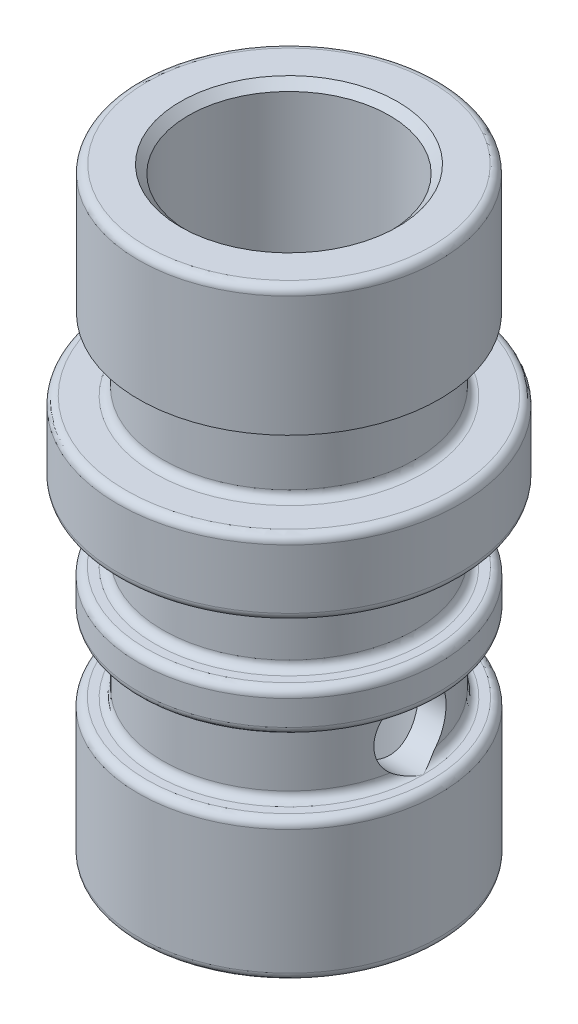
ISO-10303-21;
HEADER;
FILE_DESCRIPTION(('STEP AP214'),'2;1');
FILE_NAME('part.step','',(''),(''),'','','');
FILE_SCHEMA(('AUTOMOTIVE_DESIGN { 1 0 10303 214 1 1 1 1 }'));
ENDSEC;
DATA;
#1=APPLICATION_CONTEXT('core data for automotive mechanical design processes');
#2=APPLICATION_PROTOCOL_DEFINITION('international standard','automotive_design',2000,#1);
#3=PRODUCT_CONTEXT('',#1,'mechanical');
#4=PRODUCT('Part','Part','',(#3));
#5=PRODUCT_RELATED_PRODUCT_CATEGORY('part','',(#4));
#6=PRODUCT_DEFINITION_FORMATION('','',#4);
#7=PRODUCT_DEFINITION_CONTEXT('part definition',#1,'design');
#8=PRODUCT_DEFINITION('design','',#6,#7);
#9=PRODUCT_DEFINITION_SHAPE('','',#8);
#10=(LENGTH_UNIT() NAMED_UNIT(*) SI_UNIT(.MILLI.,.METRE.));
#11=(NAMED_UNIT(*) PLANE_ANGLE_UNIT() SI_UNIT($,.RADIAN.));
#12=(NAMED_UNIT(*) SI_UNIT($,.STERADIAN.) SOLID_ANGLE_UNIT());
#13=UNCERTAINTY_MEASURE_WITH_UNIT(LENGTH_MEASURE(1.E-05),#10,'distance_accuracy_value','');
#14=(GEOMETRIC_REPRESENTATION_CONTEXT(3) GLOBAL_UNCERTAINTY_ASSIGNED_CONTEXT((#13)) GLOBAL_UNIT_ASSIGNED_CONTEXT((#10,
#11,#12)) REPRESENTATION_CONTEXT('',''));
#15=CARTESIAN_POINT('',(0.,0.,0.));
#16=DIRECTION('',(0.,0.,1.));
#17=DIRECTION('',(1.,0.,0.));
#18=AXIS2_PLACEMENT_3D('',#15,#16,#17);
#19=CARTESIAN_POINT('',(0.,0.,0.));
#20=DIRECTION('',(0.,-1.,0.));
#21=DIRECTION('',(0.,0.,-1.));
#22=AXIS2_PLACEMENT_3D('',#19,#20,#21);
#23=CYLINDRICAL_SURFACE('',#22,7.9883);
#24=CARTESIAN_POINT('',(7.85801660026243,12.954,1.43684097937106));
#25=CARTESIAN_POINT('',(7.84885268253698,12.9134924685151,1.48696304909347));
#26=CARTESIAN_POINT('',(7.83951224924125,12.8709038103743,1.53532926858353));
#27=CARTESIAN_POINT('',(7.82073262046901,12.7818091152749,1.62828862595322));
#28=CARTESIAN_POINT('',(7.81129342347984,12.7353030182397,1.67288170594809));
#29=CARTESIAN_POINT('',(7.78321004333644,12.5902804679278,1.80060462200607));
#30=CARTESIAN_POINT('',(7.7647995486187,12.4862575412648,1.87768086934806));
#31=CARTESIAN_POINT('',(7.73072621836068,12.2663163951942,2.01338952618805));
#32=CARTESIAN_POINT('',(7.71506592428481,12.1503873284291,2.07200491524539));
#33=CARTESIAN_POINT('',(7.68839816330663,11.9098697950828,2.1688725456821));
#34=CARTESIAN_POINT('',(7.67738701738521,11.7852882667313,2.20714089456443));
#35=CARTESIAN_POINT('',(7.66158556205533,11.53393705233,2.26137873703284));
#36=CARTESIAN_POINT('',(7.65666019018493,11.4072805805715,2.27783298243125));
#37=CARTESIAN_POINT('',(7.6532026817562,11.1528962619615,2.28942510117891));
#38=CARTESIAN_POINT('',(7.65467051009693,11.025168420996,2.28456309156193));
#39=CARTESIAN_POINT('',(7.66366929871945,10.7763914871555,2.2541827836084));
#40=CARTESIAN_POINT('',(7.67101446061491,10.6552574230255,2.22929734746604));
#41=CARTESIAN_POINT('',(7.69067195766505,10.4189139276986,2.16050195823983));
#42=CARTESIAN_POINT('',(7.70298592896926,10.3037064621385,2.11658573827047));
#43=CARTESIAN_POINT('',(7.73143644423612,10.0803416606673,2.01019922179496));
#44=CARTESIAN_POINT('',(7.7476337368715,9.97233529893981,1.9474295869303));
#45=CARTESIAN_POINT('',(7.78195470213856,9.76823722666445,1.80538677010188));
#46=CARTESIAN_POINT('',(7.80007615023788,9.67213202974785,1.72613254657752));
#47=CARTESIAN_POINT('',(7.82489971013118,9.55028279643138,1.60777816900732));
#48=CARTESIAN_POINT('',(7.83160073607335,9.51836811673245,1.57485193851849));
#49=CARTESIAN_POINT('',(7.84490263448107,9.45662220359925,1.50719115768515));
#50=CARTESIAN_POINT('',(7.85150366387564,9.42678736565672,1.47245992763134));
#51=CARTESIAN_POINT('',(7.85801660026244,9.398,1.43684097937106));
#52=B_SPLINE_CURVE_WITH_KNOTS('',3,(#24,#25,#26,#27,#28,#29,#30,#31,#32,#33,#34,#35,#36,#37,#38,
#39,#40,#41,#42,#43,#44,#45,#46,#47,#48,#49,#50,#51),.UNSPECIFIED.,.F.,.F.,(4,2,2,2,2,2,2,2,2,2,
2,2,2,4),(0.,0.195157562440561,0.390318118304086,0.78062869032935,1.17129807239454,
1.56165772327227,1.94318872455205,2.32471763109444,2.69464045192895,3.06468518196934,
3.4409472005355,3.81677886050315,3.9557422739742,4.09445853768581),.UNSPECIFIED.);
#53=CARTESIAN_POINT('',(7.85801660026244,12.954,1.43684097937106));
#54=VERTEX_POINT('',#53);
#55=CARTESIAN_POINT('',(7.85801660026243,9.398,1.43684097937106));
#56=VERTEX_POINT('',#55);
#57=EDGE_CURVE('E249',#54,#56,#52,.T.);
#58=ORIENTED_EDGE('',*,*,#57,.F.);
#59=CARTESIAN_POINT('',(0.,12.954,0.));
#60=DIRECTION('',(0.,-1.,0.));
#61=DIRECTION('',(0.,0.,-1.));
#62=AXIS2_PLACEMENT_3D('',#59,#60,#61);
#63=CIRCLE('',#62,7.9883);
#64=CARTESIAN_POINT('',(-7.85801660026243,12.954,1.43684097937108));
#65=VERTEX_POINT('',#64);
#66=EDGE_CURVE('E109',#54,#65,#63,.T.);
#67=ORIENTED_EDGE('',*,*,#66,.T.);
#68=CARTESIAN_POINT('',(-7.85801660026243,9.398,1.43684097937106));
#69=CARTESIAN_POINT('',(-7.84885268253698,9.43850753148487,1.48696304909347));
#70=CARTESIAN_POINT('',(-7.83951224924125,9.48109618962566,1.53532926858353));
#71=CARTESIAN_POINT('',(-7.82073262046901,9.57019088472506,1.62828862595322));
#72=CARTESIAN_POINT('',(-7.81129342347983,9.61669698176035,1.67288170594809));
#73=CARTESIAN_POINT('',(-7.78321004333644,9.76171953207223,1.80060462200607));
#74=CARTESIAN_POINT('',(-7.7647995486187,9.86574245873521,1.87768086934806));
#75=CARTESIAN_POINT('',(-7.73072621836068,10.0856836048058,2.01338952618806));
#76=CARTESIAN_POINT('',(-7.71506592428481,10.2016126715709,2.07200491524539));
#77=CARTESIAN_POINT('',(-7.68839816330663,10.4421302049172,2.1688725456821));
#78=CARTESIAN_POINT('',(-7.67738701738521,10.5667117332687,2.20714089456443));
#79=CARTESIAN_POINT('',(-7.66158556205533,10.81806294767,2.26137873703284));
#80=CARTESIAN_POINT('',(-7.65666019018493,10.9447194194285,2.27783298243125));
#81=CARTESIAN_POINT('',(-7.6532026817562,11.1991037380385,2.28942510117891));
#82=CARTESIAN_POINT('',(-7.65467051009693,11.326831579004,2.28456309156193));
#83=CARTESIAN_POINT('',(-7.66366929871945,11.5756085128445,2.2541827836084));
#84=CARTESIAN_POINT('',(-7.67101446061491,11.6967425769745,2.22929734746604));
#85=CARTESIAN_POINT('',(-7.69067195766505,11.9330860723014,2.16050195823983));
#86=CARTESIAN_POINT('',(-7.70298592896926,12.0482935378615,2.11658573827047));
#87=CARTESIAN_POINT('',(-7.73143644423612,12.2716583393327,2.01019922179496));
#88=CARTESIAN_POINT('',(-7.7476337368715,12.3796647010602,1.9474295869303));
#89=CARTESIAN_POINT('',(-7.78195470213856,12.5837627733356,1.80538677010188));
#90=CARTESIAN_POINT('',(-7.80007615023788,12.6798679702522,1.72613254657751));
#91=CARTESIAN_POINT('',(-7.82489971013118,12.8017172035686,1.60777816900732));
#92=CARTESIAN_POINT('',(-7.83160073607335,12.8336318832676,1.57485193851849));
#93=CARTESIAN_POINT('',(-7.84490263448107,12.8953777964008,1.50719115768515));
#94=CARTESIAN_POINT('',(-7.85150366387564,12.9252126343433,1.47245992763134));
#95=CARTESIAN_POINT('',(-7.85801660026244,12.954,1.43684097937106));
#96=B_SPLINE_CURVE_WITH_KNOTS('',3,(#68,#69,#70,#71,#72,#73,#74,#75,#76,#77,#78,#79,#80,#81,#82,
#83,#84,#85,#86,#87,#88,#89,#90,#91,#92,#93,#94,#95),.UNSPECIFIED.,.F.,.F.,(4,2,2,2,2,2,2,2,2,2,
2,2,2,4),(0.,0.195157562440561,0.390318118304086,0.78062869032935,1.17129807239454,
1.56165772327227,1.94318872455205,2.32471763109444,2.69464045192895,3.06468518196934,
3.4409472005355,3.81677886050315,3.9557422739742,4.09445853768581),.UNSPECIFIED.);
#97=CARTESIAN_POINT('',(-7.85801660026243,9.398,1.43684097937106));
#98=VERTEX_POINT('',#97);
#99=EDGE_CURVE('E106',#98,#65,#96,.T.);
#100=ORIENTED_EDGE('',*,*,#99,.F.);
#101=CARTESIAN_POINT('',(0.,9.398,0.));
#102=DIRECTION('',(0.,1.,0.));
#103=DIRECTION('',(0.,0.,1.));
#104=AXIS2_PLACEMENT_3D('',#101,#102,#103);
#105=CIRCLE('',#104,7.9883);
#106=EDGE_CURVE('E113',#98,#56,#105,.T.);
#107=ORIENTED_EDGE('',*,*,#106,.T.);
#108=EDGE_LOOP('',(#58,#67,#100,#107));
#109=FACE_BOUND('',#108,.T.);
#110=ADVANCED_FACE('F32',(#109),#23,.T.);
#111=CARTESIAN_POINT('',(0.,9.398,0.));
#112=DIRECTION('',(0.,1.,0.));
#113=DIRECTION('',(0.,0.,1.));
#114=AXIS2_PLACEMENT_3D('',#111,#112,#113);
#115=TOROIDAL_SURFACE('',#114,8.4963,0.508);
#116=CARTESIAN_POINT('',(0.,8.89,0.));
#117=DIRECTION('',(0.,1.,0.));
#118=DIRECTION('',(0.,0.,1.));
#119=AXIS2_PLACEMENT_3D('',#116,#117,#118);
#120=CIRCLE('',#119,8.4963);
#121=CARTESIAN_POINT('',(8.4963,8.89,0.));
#122=VERTEX_POINT('',#121);
#123=CARTESIAN_POINT('',(-8.4963,8.89,0.));
#124=VERTEX_POINT('',#123);
#125=EDGE_CURVE('E115',#122,#124,#120,.F.);
#126=ORIENTED_EDGE('',*,*,#125,.F.);
#127=CARTESIAN_POINT('',(8.4963,8.89,0.));
#128=CARTESIAN_POINT('',(8.49494093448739,8.89000001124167,0.00288304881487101));
#129=CARTESIAN_POINT('',(8.49358058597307,8.8900054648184,0.00576566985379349));
#130=CARTESIAN_POINT('',(8.42488427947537,8.89055501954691,0.151179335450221));
#131=CARTESIAN_POINT('',(8.35448891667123,8.90439488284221,0.292636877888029));
#132=CARTESIAN_POINT('',(8.24983763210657,8.94455431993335,0.501509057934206));
#133=CARTESIAN_POINT('',(8.21502305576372,8.96124177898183,0.570753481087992));
#134=CARTESIAN_POINT('',(8.14674954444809,9.00122793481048,0.707998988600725));
#135=CARTESIAN_POINT('',(8.11328964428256,9.02452182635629,0.776000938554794));
#136=CARTESIAN_POINT('',(8.06046788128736,9.068464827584,0.886721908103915));
#137=CARTESIAN_POINT('',(8.04031170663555,9.08712628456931,0.929861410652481));
#138=CARTESIAN_POINT('',(8.00162237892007,9.12738622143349,1.015487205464));
#139=CARTESIAN_POINT('',(7.98308863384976,9.14898362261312,1.05797373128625));
#140=CARTESIAN_POINT('',(7.9483811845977,9.19509088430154,1.14196202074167));
#141=CARTESIAN_POINT('',(7.93219404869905,9.21958258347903,1.18346814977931));
#142=CARTESIAN_POINT('',(7.90291876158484,9.27167759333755,1.26558718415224));
#143=CARTESIAN_POINT('',(7.88982695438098,9.29927717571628,1.3062010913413));
#144=CARTESIAN_POINT('',(7.87471716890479,9.33960899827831,1.3615517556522));
#145=CARTESIAN_POINT('',(7.87085399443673,9.35099451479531,1.37677700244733));
#146=CARTESIAN_POINT('',(7.86384687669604,9.37424302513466,1.40706531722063));
#147=CARTESIAN_POINT('',(7.86070406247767,9.38610673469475,1.42212809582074));
#148=CARTESIAN_POINT('',(7.85797138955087,9.3982,1.437088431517));
#149=B_SPLINE_CURVE_WITH_KNOTS('',3,(#127,#128,#129,#130,#131,#132,#133,#134,#135,#136,#137,
#138,#139,#140,#141,#142,#143,#144,#145,#146,#147,#148),.UNSPECIFIED.,.F.,.F.,(4,2,2,2,2,2,2,2,
2,2,4),(0.,0.00956244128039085,0.482450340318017,0.720112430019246,0.957602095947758,
1.11093800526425,1.26421772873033,1.4165821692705,1.56876573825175,1.62694892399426,
1.68522268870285),.UNSPECIFIED.);
#150=EDGE_CURVE('E260',#122,#56,#149,.T.);
#151=ORIENTED_EDGE('',*,*,#150,.T.);
#152=ORIENTED_EDGE('',*,*,#106,.F.);
#153=CARTESIAN_POINT('',(-7.85797138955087,9.3982,1.437088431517));
#154=CARTESIAN_POINT('',(-7.86361069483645,9.37338415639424,1.40639084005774));
#155=CARTESIAN_POINT('',(-7.87091630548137,9.34954918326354,1.37527714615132));
#156=CARTESIAN_POINT('',(-7.88818656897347,9.30387918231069,1.31242668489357));
#157=CARTESIAN_POINT('',(-7.89814542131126,9.28203992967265,1.28069141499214));
#158=CARTESIAN_POINT('',(-7.92002432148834,9.24039563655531,1.21683141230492));
#159=CARTESIAN_POINT('',(-7.93193439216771,9.22058103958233,1.18470939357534));
#160=CARTESIAN_POINT('',(-7.95732007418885,9.18279710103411,1.11997483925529));
#161=CARTESIAN_POINT('',(-7.97079685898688,9.16482916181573,1.08736195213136));
#162=CARTESIAN_POINT('',(-8.00973915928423,9.11761841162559,0.996560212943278));
#163=CARTESIAN_POINT('',(-8.03647986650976,9.09028295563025,0.937917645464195));
#164=CARTESIAN_POINT('',(-8.09229011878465,9.04098285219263,0.819519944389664));
#165=CARTESIAN_POINT('',(-8.1213607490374,9.01902072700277,0.759764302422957));
#166=CARTESIAN_POINT('',(-8.2107186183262,8.96080342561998,0.578636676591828));
#167=CARTESIAN_POINT('',(-8.27304208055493,8.93233794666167,0.455639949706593));
#168=CARTESIAN_POINT('',(-8.36159994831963,8.90631875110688,0.277915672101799));
#169=CARTESIAN_POINT('',(-8.38809552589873,8.90039651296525,0.224361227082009));
#170=CARTESIAN_POINT('',(-8.44060787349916,8.89235103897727,0.116814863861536));
#171=CARTESIAN_POINT('',(-8.46662538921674,8.89022128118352,0.0628238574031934));
#172=CARTESIAN_POINT('',(-8.49358053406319,8.89000545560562,0.00576575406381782));
#173=CARTESIAN_POINT('',(-8.49494088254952,8.89000000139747,0.00288313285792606));
#174=CARTESIAN_POINT('',(-8.4963,8.89,0.));
#175=B_SPLINE_CURVE_WITH_KNOTS('',3,(#153,#154,#155,#156,#157,#158,#159,#160,#161,#162,#163,
#164,#165,#166,#167,#168,#169,#170,#171,#172,#173,#174),.UNSPECIFIED.,.F.,.F.,(4,2,2,2,2,2,2,2,
2,2,4),(0.,0.119495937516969,0.238732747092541,0.357377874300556,0.476112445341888,
0.685805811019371,0.895597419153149,1.31603209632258,1.49609128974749,1.6758405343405,
1.68540297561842),.UNSPECIFIED.);
#176=EDGE_CURVE('E105',#98,#124,#175,.T.);
#177=ORIENTED_EDGE('',*,*,#176,.T.);
#178=EDGE_LOOP('',(#126,#151,#152,#177));
#179=FACE_BOUND('',#178,.T.);
#180=ADVANCED_FACE('F299',(#179),#115,.F.);
#181=CARTESIAN_POINT('',(0.,12.954,0.));
#182=DIRECTION('',(0.,-1.,0.));
#183=DIRECTION('',(0.,0.,-1.));
#184=AXIS2_PLACEMENT_3D('',#181,#182,#183);
#185=TOROIDAL_SURFACE('',#184,8.4963,0.508);
#186=CARTESIAN_POINT('',(0.,13.462,0.));
#187=DIRECTION('',(0.,-1.,0.));
#188=DIRECTION('',(0.,0.,-1.));
#189=AXIS2_PLACEMENT_3D('',#186,#187,#188);
#190=CIRCLE('',#189,8.4963);
#191=CARTESIAN_POINT('',(8.4963,13.462,0.));
#192=VERTEX_POINT('',#191);
#193=CARTESIAN_POINT('',(-8.4963,13.462,0.));
#194=VERTEX_POINT('',#193);
#195=EDGE_CURVE('E136',#192,#194,#190,.F.);
#196=ORIENTED_EDGE('',*,*,#195,.F.);
#197=CARTESIAN_POINT('',(8.4963,13.462,0.));
#198=CARTESIAN_POINT('',(8.49494093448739,13.4619999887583,-0.00288304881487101));
#199=CARTESIAN_POINT('',(8.49358058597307,13.4619945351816,-0.00576566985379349));
#200=CARTESIAN_POINT('',(8.42488427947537,13.4614449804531,-0.151179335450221));
#201=CARTESIAN_POINT('',(8.35448891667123,13.4476051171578,-0.292636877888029));
#202=CARTESIAN_POINT('',(8.24983763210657,13.4074456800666,-0.501509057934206));
#203=CARTESIAN_POINT('',(8.21502305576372,13.3907582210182,-0.570753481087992));
#204=CARTESIAN_POINT('',(8.14674954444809,13.3507720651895,-0.707998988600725));
#205=CARTESIAN_POINT('',(8.11328964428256,13.3274781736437,-0.776000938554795));
#206=CARTESIAN_POINT('',(8.06046788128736,13.283535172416,-0.886721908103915));
#207=CARTESIAN_POINT('',(8.04031170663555,13.2648737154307,-0.92986141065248));
#208=CARTESIAN_POINT('',(8.00162237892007,13.2246137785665,-1.015487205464));
#209=CARTESIAN_POINT('',(7.98308863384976,13.2030163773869,-1.05797373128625));
#210=CARTESIAN_POINT('',(7.9483811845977,13.1569091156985,-1.14196202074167));
#211=CARTESIAN_POINT('',(7.93219404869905,13.132417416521,-1.18346814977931));
#212=CARTESIAN_POINT('',(7.90291876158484,13.0803224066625,-1.26558718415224));
#213=CARTESIAN_POINT('',(7.88982695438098,13.0527228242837,-1.3062010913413));
#214=CARTESIAN_POINT('',(7.87471716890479,13.0123910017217,-1.3615517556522));
#215=CARTESIAN_POINT('',(7.87085399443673,13.0010054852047,-1.37677700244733));
#216=CARTESIAN_POINT('',(7.86384687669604,12.9777569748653,-1.40706531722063));
#217=CARTESIAN_POINT('',(7.86070406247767,12.9658932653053,-1.42212809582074));
#218=CARTESIAN_POINT('',(7.85797138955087,12.9538,-1.437088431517));
#219=B_SPLINE_CURVE_WITH_KNOTS('',3,(#197,#198,#199,#200,#201,#202,#203,#204,#205,#206,#207,
#208,#209,#210,#211,#212,#213,#214,#215,#216,#217,#218),.UNSPECIFIED.,.F.,.F.,(4,2,2,2,2,2,2,2,
2,2,4),(0.,0.00956244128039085,0.482450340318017,0.720112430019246,0.957602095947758,
1.11093800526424,1.26421772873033,1.4165821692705,1.56876573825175,1.62694892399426,
1.68522268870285),.UNSPECIFIED.);
#220=CARTESIAN_POINT('',(7.85801660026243,12.954,-1.43684097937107));
#221=VERTEX_POINT('',#220);
#222=EDGE_CURVE('E12',#192,#221,#219,.T.);
#223=ORIENTED_EDGE('',*,*,#222,.T.);
#224=CARTESIAN_POINT('',(-7.85801660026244,12.954,-1.43684097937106));
#225=VERTEX_POINT('',#224);
#226=EDGE_CURVE('E102',#225,#221,#63,.T.);
#227=ORIENTED_EDGE('',*,*,#226,.F.);
#228=CARTESIAN_POINT('',(-7.85797138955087,12.9538,-1.437088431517));
#229=CARTESIAN_POINT('',(-7.86361069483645,12.9786158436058,-1.40639084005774));
#230=CARTESIAN_POINT('',(-7.87091630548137,13.0024508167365,-1.37527714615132));
#231=CARTESIAN_POINT('',(-7.88818656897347,13.0481208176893,-1.31242668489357));
#232=CARTESIAN_POINT('',(-7.89814542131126,13.0699600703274,-1.28069141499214));
#233=CARTESIAN_POINT('',(-7.92002432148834,13.1116043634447,-1.21683141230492));
#234=CARTESIAN_POINT('',(-7.93193439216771,13.1314189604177,-1.18470939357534));
#235=CARTESIAN_POINT('',(-7.95732007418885,13.1692028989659,-1.11997483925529));
#236=CARTESIAN_POINT('',(-7.97079685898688,13.1871708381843,-1.08736195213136));
#237=CARTESIAN_POINT('',(-8.00973915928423,13.2343815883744,-0.996560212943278));
#238=CARTESIAN_POINT('',(-8.03647986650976,13.2617170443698,-0.937917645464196));
#239=CARTESIAN_POINT('',(-8.09229011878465,13.3110171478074,-0.819519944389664));
#240=CARTESIAN_POINT('',(-8.1213607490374,13.3329792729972,-0.759764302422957));
#241=CARTESIAN_POINT('',(-8.2107186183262,13.39119657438,-0.578636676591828));
#242=CARTESIAN_POINT('',(-8.27304208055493,13.4196620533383,-0.455639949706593));
#243=CARTESIAN_POINT('',(-8.36159994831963,13.4456812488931,-0.277915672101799));
#244=CARTESIAN_POINT('',(-8.38809552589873,13.4516034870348,-0.224361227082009));
#245=CARTESIAN_POINT('',(-8.44060787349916,13.4596489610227,-0.116814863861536));
#246=CARTESIAN_POINT('',(-8.46662538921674,13.4617787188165,-0.0628238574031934));
#247=CARTESIAN_POINT('',(-8.49358053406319,13.4619945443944,-0.00576575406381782));
#248=CARTESIAN_POINT('',(-8.49494088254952,13.4619999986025,-0.00288313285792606));
#249=CARTESIAN_POINT('',(-8.4963,13.462,0.));
#250=B_SPLINE_CURVE_WITH_KNOTS('',3,(#228,#229,#230,#231,#232,#233,#234,#235,#236,#237,#238,
#239,#240,#241,#242,#243,#244,#245,#246,#247,#248,#249),.UNSPECIFIED.,.F.,.F.,(4,2,2,2,2,2,2,2,
2,2,4),(0.,0.119495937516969,0.238732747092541,0.357377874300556,0.476112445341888,
0.68580581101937,0.895597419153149,1.31603209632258,1.49609128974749,1.6758405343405,
1.68540297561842),.UNSPECIFIED.);
#251=EDGE_CURVE('E85',#225,#194,#250,.T.);
#252=ORIENTED_EDGE('',*,*,#251,.T.);
#253=EDGE_LOOP('',(#196,#223,#227,#252));
#254=FACE_BOUND('',#253,.T.);
#255=ADVANCED_FACE('F108',(#254),#185,.F.);
#256=CARTESIAN_POINT('',(9.53135,0.,0.));
#257=DIRECTION('',(0.,-1.,0.));
#258=DIRECTION('',(0.,0.,-1.));
#259=AXIS2_PLACEMENT_3D('',#256,#257,#258);
#260=PLANE('',#259);
#261=CARTESIAN_POINT('',(0.,0.,0.));
#262=DIRECTION('',(0.,-1.,0.));
#263=DIRECTION('',(0.,0.,-1.));
#264=AXIS2_PLACEMENT_3D('',#261,#262,#263);
#265=CIRCLE('',#264,6.8707);
#266=CARTESIAN_POINT('',(0.,0.,-6.8707));
#267=VERTEX_POINT('',#266);
#268=EDGE_CURVE('E130',#267,#267,#265,.F.);
#269=ORIENTED_EDGE('',*,*,#268,.T.);
#270=EDGE_LOOP('',(#269));
#271=FACE_BOUND('',#270,.T.);
#272=CARTESIAN_POINT('',(0.,0.,0.));
#273=DIRECTION('',(0.,-1.,0.));
#274=DIRECTION('',(0.,0.,-1.));
#275=AXIS2_PLACEMENT_3D('',#272,#273,#274);
#276=CIRCLE('',#275,9.02335);
#277=CARTESIAN_POINT('',(0.,0.,-9.02335));
#278=VERTEX_POINT('',#277);
#279=EDGE_CURVE('E127',#278,#278,#276,.T.);
#280=ORIENTED_EDGE('',*,*,#279,.T.);
#281=EDGE_LOOP('',(#280));
#282=FACE_BOUND('',#281,.T.);
#283=ADVANCED_FACE('F344',(#271,#282),#260,.T.);
#284=CARTESIAN_POINT('',(0.,0.,0.));
#285=DIRECTION('',(0.,-1.,0.));
#286=DIRECTION('',(0.,0.,-1.));
#287=AXIS2_PLACEMENT_3D('',#284,#285,#286);
#288=CYLINDRICAL_SURFACE('',#287,9.53135);
#289=CARTESIAN_POINT('',(0.,8.382,0.));
#290=DIRECTION('',(0.,1.,0.));
#291=DIRECTION('',(0.,0.,1.));
#292=AXIS2_PLACEMENT_3D('',#289,#290,#291);
#293=CIRCLE('',#292,9.53135);
#294=CARTESIAN_POINT('',(0.,8.382,9.53135));
#295=VERTEX_POINT('',#294);
#296=EDGE_CURVE('E124',#295,#295,#293,.F.);
#297=ORIENTED_EDGE('',*,*,#296,.T.);
#298=EDGE_LOOP('',(#297));
#299=FACE_BOUND('',#298,.T.);
#300=CARTESIAN_POINT('',(0.,0.508,0.));
#301=DIRECTION('',(0.,-1.,0.));
#302=DIRECTION('',(0.,0.,-1.));
#303=AXIS2_PLACEMENT_3D('',#300,#301,#302);
#304=CIRCLE('',#303,9.53135);
#305=CARTESIAN_POINT('',(0.,0.508,-9.53135));
#306=VERTEX_POINT('',#305);
#307=EDGE_CURVE('E121',#306,#306,#304,.F.);
#308=ORIENTED_EDGE('',*,*,#307,.T.);
#309=EDGE_LOOP('',(#308));
#310=FACE_BOUND('',#309,.T.);
#311=ADVANCED_FACE('F340',(#299,#310),#288,.T.);
#312=CARTESIAN_POINT('',(9.53135,8.89,0.));
#313=DIRECTION('',(0.,1.,0.));
#314=DIRECTION('',(0.,0.,1.));
#315=AXIS2_PLACEMENT_3D('',#312,#313,#314);
#316=PLANE('',#315);
#317=ORIENTED_EDGE('',*,*,#125,.T.);
#318=EDGE_CURVE('E110',#124,#122,#120,.F.);
#319=ORIENTED_EDGE('',*,*,#318,.T.);
#320=EDGE_LOOP('',(#317,#319));
#321=FACE_BOUND('',#320,.T.);
#322=CARTESIAN_POINT('',(0.,8.89,0.));
#323=DIRECTION('',(0.,1.,0.));
#324=DIRECTION('',(0.,0.,1.));
#325=AXIS2_PLACEMENT_3D('',#322,#323,#324);
#326=CIRCLE('',#325,9.02335);
#327=CARTESIAN_POINT('',(0.,8.89,9.02335));
#328=VERTEX_POINT('',#327);
#329=EDGE_CURVE('E282',#328,#328,#326,.T.);
#330=ORIENTED_EDGE('',*,*,#329,.T.);
#331=EDGE_LOOP('',(#330));
#332=FACE_BOUND('',#331,.T.);
#333=ADVANCED_FACE('F290',(#321,#332),#316,.T.);
#334=CARTESIAN_POINT('',(-7.85801660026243,12.954,-1.43684097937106));
#335=CARTESIAN_POINT('',(-7.84885268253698,12.9134924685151,-1.48696304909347));
#336=CARTESIAN_POINT('',(-7.83951224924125,12.8709038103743,-1.53532926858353));
#337=CARTESIAN_POINT('',(-7.82073262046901,12.7818091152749,-1.62828862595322));
#338=CARTESIAN_POINT('',(-7.81129342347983,12.7353030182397,-1.67288170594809));
#339=CARTESIAN_POINT('',(-7.78321004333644,12.5902804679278,-1.80060462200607));
#340=CARTESIAN_POINT('',(-7.7647995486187,12.4862575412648,-1.87768086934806));
#341=CARTESIAN_POINT('',(-7.73072621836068,12.2663163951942,-2.01338952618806));
#342=CARTESIAN_POINT('',(-7.71506592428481,12.1503873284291,-2.07200491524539));
#343=CARTESIAN_POINT('',(-7.68839816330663,11.9098697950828,-2.1688725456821));
#344=CARTESIAN_POINT('',(-7.67738701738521,11.7852882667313,-2.20714089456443));
#345=CARTESIAN_POINT('',(-7.66158556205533,11.53393705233,-2.26137873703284));
#346=CARTESIAN_POINT('',(-7.65666019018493,11.4072805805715,-2.27783298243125));
#347=CARTESIAN_POINT('',(-7.6532026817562,11.1528962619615,-2.28942510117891));
#348=CARTESIAN_POINT('',(-7.65467051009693,11.025168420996,-2.28456309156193));
#349=CARTESIAN_POINT('',(-7.66366929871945,10.7763914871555,-2.2541827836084));
#350=CARTESIAN_POINT('',(-7.67101446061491,10.6552574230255,-2.22929734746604));
#351=CARTESIAN_POINT('',(-7.69067195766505,10.4189139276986,-2.16050195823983));
#352=CARTESIAN_POINT('',(-7.70298592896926,10.3037064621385,-2.11658573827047));
#353=CARTESIAN_POINT('',(-7.73143644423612,10.0803416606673,-2.01019922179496));
#354=CARTESIAN_POINT('',(-7.7476337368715,9.97233529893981,-1.9474295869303));
#355=CARTESIAN_POINT('',(-7.78195470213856,9.76823722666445,-1.80538677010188));
#356=CARTESIAN_POINT('',(-7.80007615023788,9.67213202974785,-1.72613254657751));
#357=CARTESIAN_POINT('',(-7.82489971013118,9.55028279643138,-1.60777816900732));
#358=CARTESIAN_POINT('',(-7.83160073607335,9.51836811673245,-1.57485193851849));
#359=CARTESIAN_POINT('',(-7.84490263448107,9.45662220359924,-1.50719115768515));
#360=CARTESIAN_POINT('',(-7.85150366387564,9.42678736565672,-1.47245992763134));
#361=CARTESIAN_POINT('',(-7.85801660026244,9.398,-1.43684097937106));
#362=B_SPLINE_CURVE_WITH_KNOTS('',3,(#334,#335,#336,#337,#338,#339,#340,#341,#342,#343,#344,
#345,#346,#347,#348,#349,#350,#351,#352,#353,#354,#355,#356,#357,#358,#359,#360,#361),
.UNSPECIFIED.,.F.,.F.,(4,2,2,2,2,2,2,2,2,2,2,2,2,4),(0.,0.195157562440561,0.390318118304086,
0.78062869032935,1.17129807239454,1.56165772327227,1.94318872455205,2.32471763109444,
2.69464045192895,3.06468518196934,3.4409472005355,3.81677886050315,3.9557422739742,
4.09445853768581),.UNSPECIFIED.);
#363=CARTESIAN_POINT('',(-7.85801660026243,9.398,-1.43684097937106));
#364=VERTEX_POINT('',#363);
#365=EDGE_CURVE('E89',#225,#364,#362,.T.);
#366=ORIENTED_EDGE('',*,*,#365,.F.);
#367=ORIENTED_EDGE('',*,*,#226,.T.);
#368=CARTESIAN_POINT('',(7.85801660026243,9.398,-1.43684097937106));
#369=CARTESIAN_POINT('',(7.84885268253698,9.43850753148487,-1.48696304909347));
#370=CARTESIAN_POINT('',(7.83951224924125,9.48109618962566,-1.53532926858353));
#371=CARTESIAN_POINT('',(7.82073262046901,9.57019088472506,-1.62828862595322));
#372=CARTESIAN_POINT('',(7.81129342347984,9.61669698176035,-1.67288170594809));
#373=CARTESIAN_POINT('',(7.78321004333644,9.76171953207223,-1.80060462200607));
#374=CARTESIAN_POINT('',(7.7647995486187,9.86574245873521,-1.87768086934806));
#375=CARTESIAN_POINT('',(7.73072621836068,10.0856836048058,-2.01338952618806));
#376=CARTESIAN_POINT('',(7.71506592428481,10.2016126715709,-2.07200491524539));
#377=CARTESIAN_POINT('',(7.68839816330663,10.4421302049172,-2.1688725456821));
#378=CARTESIAN_POINT('',(7.67738701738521,10.5667117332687,-2.20714089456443));
#379=CARTESIAN_POINT('',(7.66158556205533,10.81806294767,-2.26137873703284));
#380=CARTESIAN_POINT('',(7.65666019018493,10.9447194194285,-2.27783298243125));
#381=CARTESIAN_POINT('',(7.6532026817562,11.1991037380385,-2.28942510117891));
#382=CARTESIAN_POINT('',(7.65467051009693,11.326831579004,-2.28456309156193));
#383=CARTESIAN_POINT('',(7.66366929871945,11.5756085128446,-2.2541827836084));
#384=CARTESIAN_POINT('',(7.67101446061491,11.6967425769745,-2.22929734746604));
#385=CARTESIAN_POINT('',(7.69067195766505,11.9330860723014,-2.16050195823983));
#386=CARTESIAN_POINT('',(7.70298592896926,12.0482935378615,-2.11658573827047));
#387=CARTESIAN_POINT('',(7.73143644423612,12.2716583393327,-2.01019922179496));
#388=CARTESIAN_POINT('',(7.7476337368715,12.3796647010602,-1.9474295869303));
#389=CARTESIAN_POINT('',(7.78195470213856,12.5837627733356,-1.80538677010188));
#390=CARTESIAN_POINT('',(7.80007615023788,12.6798679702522,-1.72613254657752));
#391=CARTESIAN_POINT('',(7.82489971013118,12.8017172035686,-1.60777816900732));
#392=CARTESIAN_POINT('',(7.83160073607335,12.8336318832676,-1.57485193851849));
#393=CARTESIAN_POINT('',(7.84490263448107,12.8953777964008,-1.50719115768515));
#394=CARTESIAN_POINT('',(7.85150366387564,12.9252126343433,-1.47245992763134));
#395=CARTESIAN_POINT('',(7.85801660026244,12.954,-1.43684097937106));
#396=B_SPLINE_CURVE_WITH_KNOTS('',3,(#368,#369,#370,#371,#372,#373,#374,#375,#376,#377,#378,
#379,#380,#381,#382,#383,#384,#385,#386,#387,#388,#389,#390,#391,#392,#393,#394,#395),
.UNSPECIFIED.,.F.,.F.,(4,2,2,2,2,2,2,2,2,2,2,2,2,4),(0.,0.195157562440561,0.390318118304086,
0.78062869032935,1.17129807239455,1.56165772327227,1.94318872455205,2.32471763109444,
2.69464045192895,3.06468518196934,3.4409472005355,3.81677886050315,3.9557422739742,
4.09445853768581),.UNSPECIFIED.);
#397=CARTESIAN_POINT('',(7.85801660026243,9.398,-1.43684097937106));
#398=VERTEX_POINT('',#397);
#399=EDGE_CURVE('E243',#398,#221,#396,.T.);
#400=ORIENTED_EDGE('',*,*,#399,.F.);
#401=EDGE_CURVE('E104',#398,#364,#105,.T.);
#402=ORIENTED_EDGE('',*,*,#401,.T.);
#403=EDGE_LOOP('',(#366,#367,#400,#402));
#404=FACE_BOUND('',#403,.T.);
#405=ADVANCED_FACE('F100',(#404),#23,.T.);
#406=CARTESIAN_POINT('',(7.9883,13.462,0.));
#407=DIRECTION('',(0.,-1.,0.));
#408=DIRECTION('',(0.,0.,-1.));
#409=AXIS2_PLACEMENT_3D('',#406,#407,#408);
#410=PLANE('',#409);
#411=ORIENTED_EDGE('',*,*,#195,.T.);
#412=EDGE_CURVE('E137',#194,#192,#190,.F.);
#413=ORIENTED_EDGE('',*,*,#412,.T.);
#414=EDGE_LOOP('',(#411,#413));
#415=FACE_BOUND('',#414,.T.);
#416=CARTESIAN_POINT('',(0.,13.462,0.));
#417=DIRECTION('',(0.,-1.,0.));
#418=DIRECTION('',(0.,0.,-1.));
#419=AXIS2_PLACEMENT_3D('',#416,#417,#418);
#420=CIRCLE('',#419,9.02335);
#421=CARTESIAN_POINT('',(0.,13.462,-9.02335));
#422=VERTEX_POINT('',#421);
#423=EDGE_CURVE('E140',#422,#422,#420,.T.);
#424=ORIENTED_EDGE('',*,*,#423,.T.);
#425=EDGE_LOOP('',(#424));
#426=FACE_BOUND('',#425,.T.);
#427=ADVANCED_FACE('F306',(#415,#426),#410,.T.);
#428=CARTESIAN_POINT('',(0.,0.,0.));
#429=DIRECTION('',(0.,-1.,0.));
#430=DIRECTION('',(0.,0.,-1.));
#431=AXIS2_PLACEMENT_3D('',#428,#429,#430);
#432=CYLINDRICAL_SURFACE('',#431,9.53135);
#433=CARTESIAN_POINT('',(0.,13.97,0.));
#434=DIRECTION('',(0.,-1.,0.));
#435=DIRECTION('',(0.,0.,-1.));
#436=AXIS2_PLACEMENT_3D('',#433,#434,#435);
#437=CIRCLE('',#436,9.53135);
#438=CARTESIAN_POINT('',(0.,13.97,-9.53135));
#439=VERTEX_POINT('',#438);
#440=EDGE_CURVE('E146',#439,#439,#437,.F.);
#441=ORIENTED_EDGE('',*,*,#440,.T.);
#442=EDGE_LOOP('',(#441));
#443=FACE_BOUND('',#442,.T.);
#444=CARTESIAN_POINT('',(0.,15.5575,0.));
#445=DIRECTION('',(0.,1.,0.));
#446=DIRECTION('',(0.,0.,1.));
#447=AXIS2_PLACEMENT_3D('',#444,#445,#446);
#448=CIRCLE('',#447,9.53135);
#449=CARTESIAN_POINT('',(0.,15.5575,9.53135));
#450=VERTEX_POINT('',#449);
#451=EDGE_CURVE('E143',#450,#450,#448,.F.);
#452=ORIENTED_EDGE('',*,*,#451,.T.);
#453=EDGE_LOOP('',(#452));
#454=FACE_BOUND('',#453,.T.);
#455=ADVANCED_FACE('F309',(#443,#454),#432,.T.);
#456=CARTESIAN_POINT('',(9.53135,16.0655,0.));
#457=DIRECTION('',(0.,1.,0.));
#458=DIRECTION('',(0.,0.,1.));
#459=AXIS2_PLACEMENT_3D('',#456,#457,#458);
#460=PLANE('',#459);
#461=CARTESIAN_POINT('',(0.,16.0655,0.));
#462=DIRECTION('',(0.,1.,0.));
#463=DIRECTION('',(0.,0.,1.));
#464=AXIS2_PLACEMENT_3D('',#461,#462,#463);
#465=CIRCLE('',#464,9.02335);
#466=CARTESIAN_POINT('',(0.,16.0655,9.02335));
#467=VERTEX_POINT('',#466);
#468=EDGE_CURVE('E152',#467,#467,#465,.T.);
#469=ORIENTED_EDGE('',*,*,#468,.T.);
#470=EDGE_LOOP('',(#469));
#471=FACE_BOUND('',#470,.T.);
#472=CARTESIAN_POINT('',(0.,16.0655,0.));
#473=DIRECTION('',(0.,1.,0.));
#474=DIRECTION('',(0.,0.,1.));
#475=AXIS2_PLACEMENT_3D('',#472,#473,#474);
#476=CIRCLE('',#475,8.4963);
#477=CARTESIAN_POINT('',(0.,16.0655,8.4963));
#478=VERTEX_POINT('',#477);
#479=EDGE_CURVE('E149',#478,#478,#476,.F.);
#480=ORIENTED_EDGE('',*,*,#479,.T.);
#481=EDGE_LOOP('',(#480));
#482=FACE_BOUND('',#481,.T.);
#483=ADVANCED_FACE('F398',(#471,#482),#460,.T.);
#484=CARTESIAN_POINT('',(0.,0.,0.));
#485=DIRECTION('',(0.,-1.,0.));
#486=DIRECTION('',(0.,0.,-1.));
#487=AXIS2_PLACEMENT_3D('',#484,#485,#486);
#488=CYLINDRICAL_SURFACE('',#487,7.9883);
#489=CARTESIAN_POINT('',(0.,16.5735,0.));
#490=DIRECTION('',(0.,1.,0.));
#491=DIRECTION('',(0.,0.,1.));
#492=AXIS2_PLACEMENT_3D('',#489,#490,#491);
#493=CIRCLE('',#492,7.9883);
#494=CARTESIAN_POINT('',(0.,16.5735,7.9883));
#495=VERTEX_POINT('',#494);
#496=EDGE_CURVE('E188',#495,#495,#493,.T.);
#497=ORIENTED_EDGE('',*,*,#496,.T.);
#498=EDGE_LOOP('',(#497));
#499=FACE_BOUND('',#498,.T.);
#500=CARTESIAN_POINT('',(0.,20.1295,0.));
#501=DIRECTION('',(0.,-1.,0.));
#502=DIRECTION('',(0.,0.,-1.));
#503=AXIS2_PLACEMENT_3D('',#500,#501,#502);
#504=CIRCLE('',#503,7.9883);
#505=CARTESIAN_POINT('',(0.,20.1295,-7.9883));
#506=VERTEX_POINT('',#505);
#507=EDGE_CURVE('E185',#506,#506,#504,.T.);
#508=ORIENTED_EDGE('',*,*,#507,.T.);
#509=EDGE_LOOP('',(#508));
#510=FACE_BOUND('',#509,.T.);
#511=ADVANCED_FACE('F400',(#499,#510),#488,.T.);
#512=CARTESIAN_POINT('',(7.9883,20.6375,0.));
#513=DIRECTION('',(0.,-1.,0.));
#514=DIRECTION('',(0.,0.,-1.));
#515=AXIS2_PLACEMENT_3D('',#512,#513,#514);
#516=PLANE('',#515);
#517=CARTESIAN_POINT('',(0.,20.6375,0.));
#518=DIRECTION('',(0.,-1.,0.));
#519=DIRECTION('',(0.,0.,-1.));
#520=AXIS2_PLACEMENT_3D('',#517,#518,#519);
#521=CIRCLE('',#520,10.3251);
#522=CARTESIAN_POINT('',(0.,20.6375,-10.3251));
#523=VERTEX_POINT('',#522);
#524=EDGE_CURVE('E158',#523,#523,#521,.T.);
#525=ORIENTED_EDGE('',*,*,#524,.T.);
#526=EDGE_LOOP('',(#525));
#527=FACE_BOUND('',#526,.T.);
#528=CARTESIAN_POINT('',(0.,20.6375,0.));
#529=DIRECTION('',(0.,-1.,0.));
#530=DIRECTION('',(0.,0.,-1.));
#531=AXIS2_PLACEMENT_3D('',#528,#529,#530);
#532=CIRCLE('',#531,8.4963);
#533=CARTESIAN_POINT('',(0.,20.6375,-8.4963));
#534=VERTEX_POINT('',#533);
#535=EDGE_CURVE('E155',#534,#534,#532,.F.);
#536=ORIENTED_EDGE('',*,*,#535,.T.);
#537=EDGE_LOOP('',(#536));
#538=FACE_BOUND('',#537,.T.);
#539=ADVANCED_FACE('F407',(#527,#538),#516,.T.);
#540=CARTESIAN_POINT('',(0.,0.,0.));
#541=DIRECTION('',(0.,-1.,0.));
#542=DIRECTION('',(0.,0.,-1.));
#543=AXIS2_PLACEMENT_3D('',#540,#541,#542);
#544=CYLINDRICAL_SURFACE('',#543,10.8331);
#545=CARTESIAN_POINT('',(0.,21.1455,0.));
#546=DIRECTION('',(0.,-1.,0.));
#547=DIRECTION('',(0.,0.,-1.));
#548=AXIS2_PLACEMENT_3D('',#545,#546,#547);
#549=CIRCLE('',#548,10.8331);
#550=CARTESIAN_POINT('',(0.,21.1455,-10.8331));
#551=VERTEX_POINT('',#550);
#552=EDGE_CURVE('E164',#551,#551,#549,.F.);
#553=ORIENTED_EDGE('',*,*,#552,.T.);
#554=EDGE_LOOP('',(#553));
#555=FACE_BOUND('',#554,.T.);
#556=CARTESIAN_POINT('',(0.,24.892,0.));
#557=DIRECTION('',(0.,1.,0.));
#558=DIRECTION('',(0.,0.,1.));
#559=AXIS2_PLACEMENT_3D('',#556,#557,#558);
#560=CIRCLE('',#559,10.8331);
#561=CARTESIAN_POINT('',(0.,24.892,10.8331));
#562=VERTEX_POINT('',#561);
#563=EDGE_CURVE('E161',#562,#562,#560,.F.);
#564=ORIENTED_EDGE('',*,*,#563,.T.);
#565=EDGE_LOOP('',(#564));
#566=FACE_BOUND('',#565,.T.);
#567=ADVANCED_FACE('F415',(#555,#566),#544,.T.);
#568=CARTESIAN_POINT('',(10.8331,25.4,0.));
#569=DIRECTION('',(0.,1.,0.));
#570=DIRECTION('',(0.,0.,1.));
#571=AXIS2_PLACEMENT_3D('',#568,#569,#570);
#572=PLANE('',#571);
#573=CARTESIAN_POINT('',(0.,25.4,0.));
#574=DIRECTION('',(0.,1.,0.));
#575=DIRECTION('',(0.,0.,1.));
#576=AXIS2_PLACEMENT_3D('',#573,#574,#575);
#577=CIRCLE('',#576,10.3251);
#578=CARTESIAN_POINT('',(0.,25.4,10.3251));
#579=VERTEX_POINT('',#578);
#580=EDGE_CURVE('E170',#579,#579,#577,.T.);
#581=ORIENTED_EDGE('',*,*,#580,.T.);
#582=EDGE_LOOP('',(#581));
#583=FACE_BOUND('',#582,.T.);
#584=CARTESIAN_POINT('',(0.,25.4,0.));
#585=DIRECTION('',(0.,1.,0.));
#586=DIRECTION('',(0.,0.,1.));
#587=AXIS2_PLACEMENT_3D('',#584,#585,#586);
#588=CIRCLE('',#587,8.4963);
#589=CARTESIAN_POINT('',(0.,25.4,8.4963));
#590=VERTEX_POINT('',#589);
#591=EDGE_CURVE('E167',#590,#590,#588,.F.);
#592=ORIENTED_EDGE('',*,*,#591,.T.);
#593=EDGE_LOOP('',(#592));
#594=FACE_BOUND('',#593,.T.);
#595=ADVANCED_FACE('F419',(#583,#594),#572,.T.);
#596=CARTESIAN_POINT('',(0.,0.,0.));
#597=DIRECTION('',(0.,-1.,0.));
#598=DIRECTION('',(0.,0.,-1.));
#599=AXIS2_PLACEMENT_3D('',#596,#597,#598);
#600=CYLINDRICAL_SURFACE('',#599,7.9883);
#601=CARTESIAN_POINT('',(0.,25.908,0.));
#602=DIRECTION('',(0.,1.,0.));
#603=DIRECTION('',(0.,0.,1.));
#604=AXIS2_PLACEMENT_3D('',#601,#602,#603);
#605=CIRCLE('',#604,7.9883);
#606=CARTESIAN_POINT('',(0.,25.908,7.9883));
#607=VERTEX_POINT('',#606);
#608=EDGE_CURVE('E182',#607,#607,#605,.T.);
#609=ORIENTED_EDGE('',*,*,#608,.T.);
#610=EDGE_LOOP('',(#609));
#611=FACE_BOUND('',#610,.T.);
#612=CARTESIAN_POINT('',(0.,29.464,0.));
#613=DIRECTION('',(0.,-1.,0.));
#614=DIRECTION('',(0.,0.,-1.));
#615=AXIS2_PLACEMENT_3D('',#612,#613,#614);
#616=CIRCLE('',#615,7.9883);
#617=CARTESIAN_POINT('',(0.,29.464,-7.9883));
#618=VERTEX_POINT('',#617);
#619=EDGE_CURVE('E179',#618,#618,#616,.T.);
#620=ORIENTED_EDGE('',*,*,#619,.T.);
#621=EDGE_LOOP('',(#620));
#622=FACE_BOUND('',#621,.T.);
#623=ADVANCED_FACE('F423',(#611,#622),#600,.T.);
#624=CARTESIAN_POINT('',(7.9883,29.972,0.));
#625=DIRECTION('',(0.,-1.,0.));
#626=DIRECTION('',(0.,0.,-1.));
#627=AXIS2_PLACEMENT_3D('',#624,#625,#626);
#628=PLANE('',#627);
#629=CARTESIAN_POINT('',(0.,29.972,0.));
#630=DIRECTION('',(0.,-1.,0.));
#631=DIRECTION('',(0.,0.,-1.));
#632=AXIS2_PLACEMENT_3D('',#629,#630,#631);
#633=CIRCLE('',#632,8.4963);
#634=CARTESIAN_POINT('',(0.,29.972,-8.4963));
#635=VERTEX_POINT('',#634);
#636=EDGE_CURVE('E95',#635,#635,#633,.F.);
#637=ORIENTED_EDGE('',*,*,#636,.T.);
#638=EDGE_LOOP('',(#637));
#639=FACE_BOUND('',#638,.T.);
#640=CARTESIAN_POINT('',(0.,29.972,0.));
#641=DIRECTION('',(0.,-1.,0.));
#642=DIRECTION('',(0.,0.,-1.));
#643=AXIS2_PLACEMENT_3D('',#640,#641,#642);
#644=CIRCLE('',#643,9.5123);
#645=CARTESIAN_POINT('',(0.,29.972,-9.5123));
#646=VERTEX_POINT('',#645);
#647=EDGE_CURVE('E274',#646,#646,#644,.T.);
#648=ORIENTED_EDGE('',*,*,#647,.T.);
#649=EDGE_LOOP('',(#648));
#650=FACE_BOUND('',#649,.T.);
#651=ADVANCED_FACE('F427',(#639,#650),#628,.T.);
#652=CARTESIAN_POINT('',(0.,0.,0.));
#653=DIRECTION('',(0.,-1.,0.));
#654=DIRECTION('',(0.,0.,-1.));
#655=AXIS2_PLACEMENT_3D('',#652,#653,#654);
#656=CYLINDRICAL_SURFACE('',#655,9.5123);
#657=CARTESIAN_POINT('',(0.,37.592,0.));
#658=DIRECTION('',(0.,1.,0.));
#659=DIRECTION('',(0.,0.,1.));
#660=AXIS2_PLACEMENT_3D('',#657,#658,#659);
#661=CIRCLE('',#660,9.5123);
#662=CARTESIAN_POINT('',(0.,37.592,9.5123));
#663=VERTEX_POINT('',#662);
#664=EDGE_CURVE('E173',#663,#663,#661,.F.);
#665=ORIENTED_EDGE('',*,*,#664,.T.);
#666=EDGE_LOOP('',(#665));
#667=FACE_BOUND('',#666,.T.);
#668=ORIENTED_EDGE('',*,*,#647,.F.);
#669=EDGE_LOOP('',(#668));
#670=FACE_BOUND('',#669,.T.);
#671=ADVANCED_FACE('F431',(#667,#670),#656,.T.);
#672=CARTESIAN_POINT('',(9.5123,38.1,0.));
#673=DIRECTION('',(0.,1.,0.));
#674=DIRECTION('',(0.,0.,1.));
#675=AXIS2_PLACEMENT_3D('',#672,#673,#674);
#676=PLANE('',#675);
#677=CARTESIAN_POINT('',(0.,38.1,0.));
#678=DIRECTION('',(0.,1.,0.));
#679=DIRECTION('',(0.,0.,1.));
#680=AXIS2_PLACEMENT_3D('',#677,#678,#679);
#681=CIRCLE('',#680,9.0043);
#682=CARTESIAN_POINT('',(0.,38.1,9.0043));
#683=VERTEX_POINT('',#682);
#684=EDGE_CURVE('E176',#683,#683,#681,.T.);
#685=ORIENTED_EDGE('',*,*,#684,.T.);
#686=EDGE_LOOP('',(#685));
#687=FACE_BOUND('',#686,.T.);
#688=CARTESIAN_POINT('',(0.,38.1,0.));
#689=DIRECTION('',(0.,1.,0.));
#690=DIRECTION('',(0.,0.,1.));
#691=AXIS2_PLACEMENT_3D('',#688,#689,#690);
#692=CIRCLE('',#691,6.87069999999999);
#693=CARTESIAN_POINT('',(0.,38.1,6.87069999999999));
#694=VERTEX_POINT('',#693);
#695=EDGE_CURVE('E280',#694,#694,#692,.F.);
#696=ORIENTED_EDGE('',*,*,#695,.T.);
#697=EDGE_LOOP('',(#696));
#698=FACE_BOUND('',#697,.T.);
#699=ADVANCED_FACE('F434',(#687,#698),#676,.T.);
#700=CARTESIAN_POINT('',(0.,0.,0.));
#701=DIRECTION('',(0.,1.,0.));
#702=DIRECTION('',(0.,0.,1.));
#703=AXIS2_PLACEMENT_3D('',#700,#701,#702);
#704=CYLINDRICAL_SURFACE('',#703,6.3627);
#705=CARTESIAN_POINT('',(-5.93785780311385,11.176,-2.286));
#706=CARTESIAN_POINT('',(-5.93785524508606,11.0521290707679,-2.28600289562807));
#707=CARTESIAN_POINT('',(-5.94177616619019,10.9282780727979,-2.27589802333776));
#708=CARTESIAN_POINT('',(-5.95693753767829,10.684285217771,-2.23591063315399));
#709=CARTESIAN_POINT('',(-5.96817827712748,10.5641435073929,-2.20602733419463));
#710=CARTESIAN_POINT('',(-5.9965451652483,10.3311527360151,-2.12770064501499));
#711=CARTESIAN_POINT('',(-6.01365822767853,10.2182881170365,-2.07929849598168));
#712=CARTESIAN_POINT('',(-6.05182128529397,10.0022394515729,-1.96545233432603));
#713=CARTESIAN_POINT('',(-6.07287235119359,9.89905804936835,-1.90000368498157));
#714=CARTESIAN_POINT('',(-6.11761428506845,9.70060481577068,-1.750729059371));
#715=CARTESIAN_POINT('',(-6.14137835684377,9.60583722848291,-1.66625448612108));
#716=CARTESIAN_POINT('',(-6.18825496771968,9.43146266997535,-1.48270522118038));
#717=CARTESIAN_POINT('',(-6.21136738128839,9.35185860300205,-1.38362773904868));
#718=CARTESIAN_POINT('',(-6.25519781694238,9.20769736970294,-1.1699123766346));
#719=CARTESIAN_POINT('',(-6.27581989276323,9.14368059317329,-1.054888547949));
#720=CARTESIAN_POINT('',(-6.3114730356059,9.03611110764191,-0.814833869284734));
#721=CARTESIAN_POINT('',(-6.32650587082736,8.9925519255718,-0.689806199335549));
#722=CARTESIAN_POINT('',(-6.34876756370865,8.92887962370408,-0.438588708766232));
#723=CARTESIAN_POINT('',(-6.3562839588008,8.90790007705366,-0.312644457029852));
#724=CARTESIAN_POINT('',(-6.36369340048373,8.88721470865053,-0.0588136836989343));
#725=CARTESIAN_POINT('',(-6.36358872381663,8.8875025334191,0.0690722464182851));
#726=CARTESIAN_POINT('',(-6.35595540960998,8.90882155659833,0.316976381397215));
#727=CARTESIAN_POINT('',(-6.3487645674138,8.92890892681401,0.437087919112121));
#728=CARTESIAN_POINT('',(-6.32820255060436,8.98767968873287,0.672105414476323));
#729=CARTESIAN_POINT('',(-6.31483094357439,9.02636438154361,0.787011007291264));
#730=CARTESIAN_POINT('',(-6.28300966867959,9.12171279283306,1.01027024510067));
#731=CARTESIAN_POINT('',(-6.26449109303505,9.17862220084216,1.11850873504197));
#732=CARTESIAN_POINT('',(-6.22427101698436,9.30859347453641,1.32415909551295));
#733=CARTESIAN_POINT('',(-6.20256854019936,9.38166029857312,1.42156762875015));
#734=CARTESIAN_POINT('',(-6.15685148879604,9.54650285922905,1.60837759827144));
#735=CARTESIAN_POINT('',(-6.1327753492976,9.63907706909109,1.69706045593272));
#736=CARTESIAN_POINT('',(-6.08598353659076,9.83795379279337,1.85789896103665));
#737=CARTESIAN_POINT('',(-6.0632681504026,9.9442591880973,1.93005113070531));
#738=CARTESIAN_POINT('',(-6.02140094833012,10.1701954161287,2.05700043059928));
#739=CARTESIAN_POINT('',(-6.00232460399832,10.2900401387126,2.1114437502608));
#740=CARTESIAN_POINT('',(-5.970765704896,10.5380601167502,2.19911463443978));
#741=CARTESIAN_POINT('',(-5.9582798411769,10.6662311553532,2.23235284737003));
#742=CARTESIAN_POINT('',(-5.94208356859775,10.9202148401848,2.27510285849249));
#743=CARTESIAN_POINT('',(-5.93795524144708,11.045810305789,2.28574596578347));
#744=CARTESIAN_POINT('',(-5.93776389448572,11.2970332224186,2.28624486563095));
#745=CARTESIAN_POINT('',(-5.94169908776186,11.4226606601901,2.2761052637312));
#746=CARTESIAN_POINT('',(-5.95676986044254,11.664843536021,2.23634910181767));
#747=CARTESIAN_POINT('',(-5.9675949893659,11.781558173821,2.2075714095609));
#748=CARTESIAN_POINT('',(-5.99486802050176,12.0084613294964,2.13239217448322));
#749=CARTESIAN_POINT('',(-6.01131701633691,12.118648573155,2.08598720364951));
#750=CARTESIAN_POINT('',(-6.04870224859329,12.3336985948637,1.9750155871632));
#751=CARTESIAN_POINT('',(-6.0697766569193,12.4382350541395,1.90986445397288));
#752=CARTESIAN_POINT('',(-6.11379238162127,12.6352963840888,1.76388712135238));
#753=CARTESIAN_POINT('',(-6.13673432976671,12.7278171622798,1.68305560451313));
#754=CARTESIAN_POINT('',(-6.18348983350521,12.9037141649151,1.50252234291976));
#755=CARTESIAN_POINT('',(-6.20727798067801,12.9862623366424,1.4020045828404));
#756=CARTESIAN_POINT('',(-6.25177121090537,13.1334008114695,1.18795649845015));
#757=CARTESIAN_POINT('',(-6.2724763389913,13.1979913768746,1.07442636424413));
#758=CARTESIAN_POINT('',(-6.30841863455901,13.3068747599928,0.83787260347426));
#759=CARTESIAN_POINT('',(-6.32368238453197,13.3512665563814,0.71489879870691));
#760=CARTESIAN_POINT('',(-6.34712617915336,13.4185121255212,0.46256267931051));
#761=CARTESIAN_POINT('',(-6.35530924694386,13.4413750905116,0.333203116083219));
#762=CARTESIAN_POINT('',(-6.36340558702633,13.4639848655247,0.0792848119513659));
#763=CARTESIAN_POINT('',(-6.36374126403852,13.4649124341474,-0.0451563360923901));
#764=CARTESIAN_POINT('',(-6.35718247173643,13.4466138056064,-0.292341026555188));
#765=CARTESIAN_POINT('',(-6.35028875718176,13.4273897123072,-0.415084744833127));
#766=CARTESIAN_POINT('',(-6.33022489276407,13.3701480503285,-0.652803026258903));
#767=CARTESIAN_POINT('',(-6.31718890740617,13.3325315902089,-0.767886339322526));
#768=CARTESIAN_POINT('',(-6.28619058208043,13.2399604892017,-0.990132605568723));
#769=CARTESIAN_POINT('',(-6.26822731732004,13.1850025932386,-1.09729406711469));
#770=CARTESIAN_POINT('',(-6.22829207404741,13.0567764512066,-1.30537661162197));
#771=CARTESIAN_POINT('',(-6.20618771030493,12.9828595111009,-1.40587212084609));
#772=CARTESIAN_POINT('',(-6.16070887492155,12.8198664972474,-1.59340679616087));
#773=CARTESIAN_POINT('',(-6.13733396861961,12.7307852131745,-1.68044131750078));
#774=CARTESIAN_POINT('',(-6.09060592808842,12.5349599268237,-1.84281106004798));
#775=CARTESIAN_POINT('',(-6.06730635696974,12.4275788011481,-1.91739607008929));
#776=CARTESIAN_POINT('',(-6.02466383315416,12.2010682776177,-2.04745727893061));
#777=CARTESIAN_POINT('',(-6.00532068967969,12.0819394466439,-2.10293439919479));
#778=CARTESIAN_POINT('',(-5.97293584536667,11.8340327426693,-2.19324717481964));
#779=CARTESIAN_POINT('',(-5.95995087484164,11.7051794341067,-2.22789760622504));
#780=CARTESIAN_POINT('',(-5.94241541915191,11.4428747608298,-2.27426651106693));
#781=CARTESIAN_POINT('',(-5.93786055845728,11.3094258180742,-2.28599688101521));
#782=CARTESIAN_POINT('',(-5.93785780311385,11.176,-2.286));
#783=B_SPLINE_CURVE_WITH_KNOTS('',3,(#705,#706,#707,#708,#709,#710,#711,#712,#713,#714,#715,
#716,#717,#718,#719,#720,#721,#722,#723,#724,#725,#726,#727,#728,#729,#730,#731,#732,#733,#734,
#735,#736,#737,#738,#739,#740,#741,#742,#743,#744,#745,#746,#747,#748,#749,#750,#751,#752,#753,
#754,#755,#756,#757,#758,#759,#760,#761,#762,#763,#764,#765,#766,#767,#768,#769,#770,#771,#772,
#773,#774,#775,#776,#777,#778,#779,#780,#781,#782),.UNSPECIFIED.,.T.,.F.,(4,2,2,2,2,2,2,2,2,2,2,
2,2,2,2,2,2,2,2,2,2,2,2,2,2,2,2,2,2,2,2,2,2,2,2,2,2,2,4),(0.,0.371117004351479,
0.742248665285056,1.11255858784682,1.48296934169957,1.86871372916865,2.25453192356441,
2.65226095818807,3.04986406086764,3.4315973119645,3.81321652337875,4.17748292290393,
4.54177481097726,4.9112005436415,5.2807398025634,5.67027708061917,6.05989623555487,
6.45687971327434,6.85366368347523,7.23006105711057,7.60637502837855,7.966829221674,
8.32735354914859,8.70063358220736,9.07404042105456,9.46884909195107,9.86365199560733,
10.2564988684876,10.6491779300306,11.0206683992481,11.3921200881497,11.7558098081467,
12.1195678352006,12.4979864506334,12.8765353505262,13.2730297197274,13.669504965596,
14.0694560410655,14.4691994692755),.UNSPECIFIED.);
#784=CARTESIAN_POINT('',(-5.93785780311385,11.176,-2.286));
#785=VERTEX_POINT('',#784);
#786=EDGE_CURVE('E269',#785,#785,#783,.T.);
#787=ORIENTED_EDGE('',*,*,#786,.T.);
#788=EDGE_LOOP('',(#787));
#789=FACE_BOUND('',#788,.T.);
#790=CARTESIAN_POINT('',(5.93785780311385,11.176,-2.286));
#791=CARTESIAN_POINT('',(5.93785524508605,11.2998709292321,-2.28600289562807));
#792=CARTESIAN_POINT('',(5.94177616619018,11.4237219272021,-2.27589802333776));
#793=CARTESIAN_POINT('',(5.95693753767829,11.667714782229,-2.23591063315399));
#794=CARTESIAN_POINT('',(5.96817827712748,11.7878564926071,-2.20602733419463));
#795=CARTESIAN_POINT('',(5.9965451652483,12.0208472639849,-2.127700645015));
#796=CARTESIAN_POINT('',(6.01365822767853,12.1337118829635,-2.07929849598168));
#797=CARTESIAN_POINT('',(6.05182128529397,12.3497605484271,-1.96545233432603));
#798=CARTESIAN_POINT('',(6.07287235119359,12.4529419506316,-1.90000368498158));
#799=CARTESIAN_POINT('',(6.11761428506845,12.6513951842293,-1.75072905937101));
#800=CARTESIAN_POINT('',(6.14137835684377,12.7461627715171,-1.66625448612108));
#801=CARTESIAN_POINT('',(6.18825496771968,12.9205373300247,-1.48270522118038));
#802=CARTESIAN_POINT('',(6.21136738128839,13.000141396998,-1.38362773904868));
#803=CARTESIAN_POINT('',(6.25519781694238,13.1443026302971,-1.16991237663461));
#804=CARTESIAN_POINT('',(6.27581989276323,13.2083194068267,-1.054888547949));
#805=CARTESIAN_POINT('',(6.3114730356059,13.3158888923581,-0.814833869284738));
#806=CARTESIAN_POINT('',(6.32650587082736,13.3594480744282,-0.689806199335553));
#807=CARTESIAN_POINT('',(6.34876756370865,13.4231203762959,-0.438588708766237));
#808=CARTESIAN_POINT('',(6.3562839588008,13.4440999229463,-0.312644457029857));
#809=CARTESIAN_POINT('',(6.36369340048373,13.4647852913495,-0.0588136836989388));
#810=CARTESIAN_POINT('',(6.36358872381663,13.4644974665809,0.0690722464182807));
#811=CARTESIAN_POINT('',(6.35595540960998,13.4431784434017,0.316976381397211));
#812=CARTESIAN_POINT('',(6.3487645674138,13.423091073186,0.437087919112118));
#813=CARTESIAN_POINT('',(6.32820255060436,13.3643203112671,0.672105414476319));
#814=CARTESIAN_POINT('',(6.31483094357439,13.3256356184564,0.787011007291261));
#815=CARTESIAN_POINT('',(6.28300966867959,13.2302872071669,1.01027024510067));
#816=CARTESIAN_POINT('',(6.26449109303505,13.1733777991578,1.11850873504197));
#817=CARTESIAN_POINT('',(6.22427101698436,13.0434065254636,1.32415909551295));
#818=CARTESIAN_POINT('',(6.20256854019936,12.9703397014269,1.42156762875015));
#819=CARTESIAN_POINT('',(6.15685148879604,12.805497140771,1.60837759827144));
#820=CARTESIAN_POINT('',(6.1327753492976,12.7129229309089,1.69706045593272));
#821=CARTESIAN_POINT('',(6.08598353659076,12.5140462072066,1.85789896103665));
#822=CARTESIAN_POINT('',(6.0632681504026,12.4077408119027,1.93005113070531));
#823=CARTESIAN_POINT('',(6.02140094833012,12.1818045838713,2.05700043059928));
#824=CARTESIAN_POINT('',(6.00232460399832,12.0619598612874,2.1114437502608));
#825=CARTESIAN_POINT('',(5.970765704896,11.8139398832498,2.19911463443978));
#826=CARTESIAN_POINT('',(5.9582798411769,11.6857688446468,2.23235284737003));
#827=CARTESIAN_POINT('',(5.94208356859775,11.4317851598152,2.27510285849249));
#828=CARTESIAN_POINT('',(5.93795524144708,11.306189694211,2.28574596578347));
#829=CARTESIAN_POINT('',(5.93776389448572,11.0549667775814,2.28624486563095));
#830=CARTESIAN_POINT('',(5.94169908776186,10.9293393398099,2.2761052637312));
#831=CARTESIAN_POINT('',(5.95676986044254,10.687156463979,2.23634910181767));
#832=CARTESIAN_POINT('',(5.9675949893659,10.570441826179,2.2075714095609));
#833=CARTESIAN_POINT('',(5.99486802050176,10.3435386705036,2.13239217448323));
#834=CARTESIAN_POINT('',(6.01131701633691,10.233351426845,2.08598720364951));
#835=CARTESIAN_POINT('',(6.04870224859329,10.0183014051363,1.9750155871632));
#836=CARTESIAN_POINT('',(6.0697766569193,9.91376494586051,1.90986445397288));
#837=CARTESIAN_POINT('',(6.11379238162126,9.71670361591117,1.76388712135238));
#838=CARTESIAN_POINT('',(6.1367343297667,9.62418283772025,1.68305560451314));
#839=CARTESIAN_POINT('',(6.18348983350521,9.44828583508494,1.50252234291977));
#840=CARTESIAN_POINT('',(6.207277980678,9.36573766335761,1.40200458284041));
#841=CARTESIAN_POINT('',(6.25177121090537,9.21859918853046,1.18795649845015));
#842=CARTESIAN_POINT('',(6.2724763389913,9.15400862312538,1.07442636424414));
#843=CARTESIAN_POINT('',(6.30841863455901,9.04512524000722,0.837872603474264));
#844=CARTESIAN_POINT('',(6.32368238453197,9.00073344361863,0.714898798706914));
#845=CARTESIAN_POINT('',(6.34712617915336,8.93348787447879,0.462562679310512));
#846=CARTESIAN_POINT('',(6.35530924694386,8.91062490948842,0.333203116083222));
#847=CARTESIAN_POINT('',(6.36340558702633,8.88801513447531,0.0792848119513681));
#848=CARTESIAN_POINT('',(6.36374126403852,8.88708756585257,-0.045156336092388));
#849=CARTESIAN_POINT('',(6.35718247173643,8.90538619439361,-0.292341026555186));
#850=CARTESIAN_POINT('',(6.35028875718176,8.92461028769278,-0.415084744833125));
#851=CARTESIAN_POINT('',(6.33022489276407,8.9818519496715,-0.652803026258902));
#852=CARTESIAN_POINT('',(6.31718890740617,9.0194684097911,-0.767886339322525));
#853=CARTESIAN_POINT('',(6.28619058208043,9.1120395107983,-0.990132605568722));
#854=CARTESIAN_POINT('',(6.26822731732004,9.16699740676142,-1.09729406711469));
#855=CARTESIAN_POINT('',(6.22829207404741,9.29522354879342,-1.30537661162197));
#856=CARTESIAN_POINT('',(6.20618771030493,9.3691404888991,-1.40587212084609));
#857=CARTESIAN_POINT('',(6.16070887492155,9.53213350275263,-1.59340679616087));
#858=CARTESIAN_POINT('',(6.13733396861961,9.62121478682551,-1.68044131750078));
#859=CARTESIAN_POINT('',(6.09060592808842,9.81704007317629,-1.84281106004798));
#860=CARTESIAN_POINT('',(6.06730635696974,9.92442119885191,-1.91739607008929));
#861=CARTESIAN_POINT('',(6.02466383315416,10.1509317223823,-2.04745727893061));
#862=CARTESIAN_POINT('',(6.00532068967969,10.2700605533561,-2.10293439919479));
#863=CARTESIAN_POINT('',(5.97293584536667,10.5179672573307,-2.19324717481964));
#864=CARTESIAN_POINT('',(5.95995087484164,10.6468205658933,-2.22789760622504));
#865=CARTESIAN_POINT('',(5.94241541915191,10.9091252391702,-2.27426651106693));
#866=CARTESIAN_POINT('',(5.93786055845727,11.0425741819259,-2.28599688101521));
#867=CARTESIAN_POINT('',(5.93785780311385,11.176,-2.286));
#868=B_SPLINE_CURVE_WITH_KNOTS('',3,(#790,#791,#792,#793,#794,#795,#796,#797,#798,#799,#800,
#801,#802,#803,#804,#805,#806,#807,#808,#809,#810,#811,#812,#813,#814,#815,#816,#817,#818,#819,
#820,#821,#822,#823,#824,#825,#826,#827,#828,#829,#830,#831,#832,#833,#834,#835,#836,#837,#838,
#839,#840,#841,#842,#843,#844,#845,#846,#847,#848,#849,#850,#851,#852,#853,#854,#855,#856,#857,
#858,#859,#860,#861,#862,#863,#864,#865,#866,#867),.UNSPECIFIED.,.T.,.F.,(4,2,2,2,2,2,2,2,2,2,2,
2,2,2,2,2,2,2,2,2,2,2,2,2,2,2,2,2,2,2,2,2,2,2,2,2,2,2,4),(0.,0.371117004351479,
0.742248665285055,1.11255858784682,1.48296934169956,1.86871372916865,2.25453192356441,
2.65226095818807,3.04986406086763,3.43159731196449,3.81321652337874,4.17748292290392,
4.54177481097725,4.9112005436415,5.2807398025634,5.67027708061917,6.05989623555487,
6.45687971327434,6.85366368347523,7.23006105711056,7.60637502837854,7.966829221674,
8.32735354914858,8.70063358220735,9.07404042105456,9.46884909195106,9.86365199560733,
10.2564988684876,10.6491779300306,11.0206683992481,11.3921200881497,11.7558098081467,
12.1195678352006,12.4979864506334,12.8765353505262,13.2730297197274,13.669504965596,
14.0694560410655,14.4691994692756),.UNSPECIFIED.);
#869=CARTESIAN_POINT('',(5.93785780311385,11.176,-2.286));
#870=VERTEX_POINT('',#869);
#871=EDGE_CURVE('E265',#870,#870,#868,.T.);
#872=ORIENTED_EDGE('',*,*,#871,.T.);
#873=EDGE_LOOP('',(#872));
#874=FACE_BOUND('',#873,.T.);
#875=CARTESIAN_POINT('',(0.,0.508,0.));
#876=DIRECTION('',(0.,-1.,0.));
#877=DIRECTION('',(0.,0.,-1.));
#878=AXIS2_PLACEMENT_3D('',#875,#876,#877);
#879=CIRCLE('',#878,6.3627);
#880=CARTESIAN_POINT('',(0.,0.508,-6.3627));
#881=VERTEX_POINT('',#880);
#882=EDGE_CURVE('E133',#881,#881,#879,.T.);
#883=ORIENTED_EDGE('',*,*,#882,.T.);
#884=EDGE_LOOP('',(#883));
#885=FACE_BOUND('',#884,.T.);
#886=CARTESIAN_POINT('',(0.,37.592,0.));
#887=DIRECTION('',(0.,1.,0.));
#888=DIRECTION('',(0.,0.,1.));
#889=AXIS2_PLACEMENT_3D('',#886,#887,#888);
#890=CIRCLE('',#889,6.3627);
#891=CARTESIAN_POINT('',(0.,37.592,6.3627));
#892=VERTEX_POINT('',#891);
#893=EDGE_CURVE('E277',#892,#892,#890,.T.);
#894=ORIENTED_EDGE('',*,*,#893,.T.);
#895=EDGE_LOOP('',(#894));
#896=FACE_BOUND('',#895,.T.);
#897=ADVANCED_FACE('F206',(#789,#874,#885,#896),#704,.F.);
#898=CARTESIAN_POINT('',(0.,37.592,0.));
#899=DIRECTION('',(0.,1.,0.));
#900=DIRECTION('',(0.,0.,1.));
#901=AXIS2_PLACEMENT_3D('',#898,#899,#900);
#902=CONICAL_SURFACE('',#901,6.3627,0.785398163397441);
#903=ORIENTED_EDGE('',*,*,#695,.F.);
#904=EDGE_LOOP('',(#903));
#905=FACE_BOUND('',#904,.T.);
#906=ORIENTED_EDGE('',*,*,#893,.F.);
#907=EDGE_LOOP('',(#906));
#908=FACE_BOUND('',#907,.T.);
#909=ADVANCED_FACE('F351',(#905,#908),#902,.F.);
#910=ORIENTED_EDGE('',*,*,#401,.F.);
#911=CARTESIAN_POINT('',(7.85797138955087,9.3982,-1.437088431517));
#912=CARTESIAN_POINT('',(7.86361069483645,9.37338415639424,-1.40639084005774));
#913=CARTESIAN_POINT('',(7.87091630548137,9.34954918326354,-1.37527714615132));
#914=CARTESIAN_POINT('',(7.88818656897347,9.30387918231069,-1.31242668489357));
#915=CARTESIAN_POINT('',(7.89814542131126,9.28203992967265,-1.28069141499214));
#916=CARTESIAN_POINT('',(7.92002432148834,9.24039563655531,-1.21683141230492));
#917=CARTESIAN_POINT('',(7.93193439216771,9.22058103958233,-1.18470939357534));
#918=CARTESIAN_POINT('',(7.95732007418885,9.18279710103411,-1.11997483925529));
#919=CARTESIAN_POINT('',(7.97079685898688,9.16482916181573,-1.08736195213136));
#920=CARTESIAN_POINT('',(8.00973915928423,9.11761841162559,-0.996560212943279));
#921=CARTESIAN_POINT('',(8.03647986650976,9.09028295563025,-0.937917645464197));
#922=CARTESIAN_POINT('',(8.09229011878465,9.04098285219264,-0.819519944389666));
#923=CARTESIAN_POINT('',(8.1213607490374,9.01902072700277,-0.759764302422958));
#924=CARTESIAN_POINT('',(8.2107186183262,8.96080342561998,-0.578636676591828));
#925=CARTESIAN_POINT('',(8.27304208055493,8.93233794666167,-0.455639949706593));
#926=CARTESIAN_POINT('',(8.36159994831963,8.90631875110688,-0.2779156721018));
#927=CARTESIAN_POINT('',(8.38809552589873,8.90039651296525,-0.22436122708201));
#928=CARTESIAN_POINT('',(8.44060787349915,8.89235103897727,-0.116814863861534));
#929=CARTESIAN_POINT('',(8.46662538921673,8.89022128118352,-0.0628238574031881));
#930=CARTESIAN_POINT('',(8.49358053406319,8.89000545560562,-0.00576575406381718));
#931=CARTESIAN_POINT('',(8.49494088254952,8.89000000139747,-0.00288313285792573));
#932=CARTESIAN_POINT('',(8.4963,8.89,0.));
#933=B_SPLINE_CURVE_WITH_KNOTS('',3,(#911,#912,#913,#914,#915,#916,#917,#918,#919,#920,#921,
#922,#923,#924,#925,#926,#927,#928,#929,#930,#931,#932),.UNSPECIFIED.,.F.,.F.,(4,2,2,2,2,2,2,2,
2,2,4),(0.,0.11949593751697,0.238732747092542,0.357377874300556,0.476112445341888,
0.685805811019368,0.895597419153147,1.31603209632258,1.49609128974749,1.6758405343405,
1.68540297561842),.UNSPECIFIED.);
#934=EDGE_CURVE('E255',#398,#122,#933,.T.);
#935=ORIENTED_EDGE('',*,*,#934,.T.);
#936=ORIENTED_EDGE('',*,*,#318,.F.);
#937=CARTESIAN_POINT('',(-8.4963,8.89,0.));
#938=CARTESIAN_POINT('',(-8.49494093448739,8.89000001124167,-0.00288304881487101));
#939=CARTESIAN_POINT('',(-8.49358058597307,8.8900054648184,-0.00576566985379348));
#940=CARTESIAN_POINT('',(-8.42488427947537,8.89055501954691,-0.151179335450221));
#941=CARTESIAN_POINT('',(-8.35448891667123,8.90439488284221,-0.292636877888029));
#942=CARTESIAN_POINT('',(-8.24983763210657,8.94455431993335,-0.501509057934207));
#943=CARTESIAN_POINT('',(-8.21502305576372,8.96124177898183,-0.570753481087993));
#944=CARTESIAN_POINT('',(-8.14674954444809,9.00122793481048,-0.707998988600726));
#945=CARTESIAN_POINT('',(-8.11328964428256,9.02452182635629,-0.776000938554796));
#946=CARTESIAN_POINT('',(-8.06046788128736,9.068464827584,-0.886721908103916));
#947=CARTESIAN_POINT('',(-8.04031170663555,9.08712628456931,-0.929861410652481));
#948=CARTESIAN_POINT('',(-8.00162237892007,9.12738622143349,-1.015487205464));
#949=CARTESIAN_POINT('',(-7.98308863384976,9.14898362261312,-1.05797373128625));
#950=CARTESIAN_POINT('',(-7.9483811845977,9.19509088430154,-1.14196202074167));
#951=CARTESIAN_POINT('',(-7.93219404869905,9.21958258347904,-1.18346814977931));
#952=CARTESIAN_POINT('',(-7.90291876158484,9.27167759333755,-1.26558718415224));
#953=CARTESIAN_POINT('',(-7.88982695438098,9.29927717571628,-1.3062010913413));
#954=CARTESIAN_POINT('',(-7.87471716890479,9.33960899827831,-1.3615517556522));
#955=CARTESIAN_POINT('',(-7.87085399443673,9.35099451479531,-1.37677700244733));
#956=CARTESIAN_POINT('',(-7.86384687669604,9.37424302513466,-1.40706531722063));
#957=CARTESIAN_POINT('',(-7.86070406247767,9.38610673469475,-1.42212809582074));
#958=CARTESIAN_POINT('',(-7.85797138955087,9.3982,-1.437088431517));
#959=B_SPLINE_CURVE_WITH_KNOTS('',3,(#937,#938,#939,#940,#941,#942,#943,#944,#945,#946,#947,
#948,#949,#950,#951,#952,#953,#954,#955,#956,#957,#958),.UNSPECIFIED.,.F.,.F.,(4,2,2,2,2,2,2,2,
2,2,4),(0.,0.00956244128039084,0.482450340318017,0.720112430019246,0.957602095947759,
1.11093800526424,1.26421772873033,1.4165821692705,1.56876573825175,1.62694892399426,
1.68522268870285),.UNSPECIFIED.);
#960=EDGE_CURVE('E237',#124,#364,#959,.T.);
#961=ORIENTED_EDGE('',*,*,#960,.T.);
#962=EDGE_LOOP('',(#910,#935,#936,#961));
#963=FACE_BOUND('',#962,.T.);
#964=ADVANCED_FACE('F296',(#963),#115,.F.);
#965=CARTESIAN_POINT('',(0.,8.382,0.));
#966=DIRECTION('',(0.,1.,0.));
#967=DIRECTION('',(0.,0.,1.));
#968=AXIS2_PLACEMENT_3D('',#965,#966,#967);
#969=TOROIDAL_SURFACE('',#968,9.02335,0.508);
#970=ORIENTED_EDGE('',*,*,#329,.F.);
#971=EDGE_LOOP('',(#970));
#972=FACE_BOUND('',#971,.T.);
#973=ORIENTED_EDGE('',*,*,#296,.F.);
#974=EDGE_LOOP('',(#973));
#975=FACE_BOUND('',#974,.T.);
#976=ADVANCED_FACE('F326',(#972,#975),#969,.T.);
#977=CARTESIAN_POINT('',(0.,0.508,0.));
#978=DIRECTION('',(0.,-1.,0.));
#979=DIRECTION('',(0.,0.,-1.));
#980=AXIS2_PLACEMENT_3D('',#977,#978,#979);
#981=TOROIDAL_SURFACE('',#980,6.8707,0.508);
#982=ORIENTED_EDGE('',*,*,#882,.F.);
#983=EDGE_LOOP('',(#982));
#984=FACE_BOUND('',#983,.T.);
#985=ORIENTED_EDGE('',*,*,#268,.F.);
#986=EDGE_LOOP('',(#985));
#987=FACE_BOUND('',#986,.T.);
#988=ADVANCED_FACE('F316',(#984,#987),#981,.T.);
#989=CARTESIAN_POINT('',(0.,13.97,0.));
#990=DIRECTION('',(0.,-1.,0.));
#991=DIRECTION('',(0.,0.,-1.));
#992=AXIS2_PLACEMENT_3D('',#989,#990,#991);
#993=TOROIDAL_SURFACE('',#992,9.02335,0.508);
#994=ORIENTED_EDGE('',*,*,#440,.F.);
#995=EDGE_LOOP('',(#994));
#996=FACE_BOUND('',#995,.T.);
#997=ORIENTED_EDGE('',*,*,#423,.F.);
#998=EDGE_LOOP('',(#997));
#999=FACE_BOUND('',#998,.T.);
#1000=ADVANCED_FACE('F313',(#996,#999),#993,.T.);
#1001=CARTESIAN_POINT('',(0.,15.5575,0.));
#1002=DIRECTION('',(0.,1.,0.));
#1003=DIRECTION('',(0.,0.,1.));
#1004=AXIS2_PLACEMENT_3D('',#1001,#1002,#1003);
#1005=TOROIDAL_SURFACE('',#1004,9.02335,0.508);
#1006=ORIENTED_EDGE('',*,*,#468,.F.);
#1007=EDGE_LOOP('',(#1006));
#1008=FACE_BOUND('',#1007,.T.);
#1009=ORIENTED_EDGE('',*,*,#451,.F.);
#1010=EDGE_LOOP('',(#1009));
#1011=FACE_BOUND('',#1010,.T.);
#1012=ADVANCED_FACE('F315',(#1008,#1011),#1005,.T.);
#1013=CARTESIAN_POINT('',(0.,21.1455,0.));
#1014=DIRECTION('',(0.,-1.,0.));
#1015=DIRECTION('',(0.,0.,-1.));
#1016=AXIS2_PLACEMENT_3D('',#1013,#1014,#1015);
#1017=TOROIDAL_SURFACE('',#1016,10.3251,0.508);
#1018=ORIENTED_EDGE('',*,*,#552,.F.);
#1019=EDGE_LOOP('',(#1018));
#1020=FACE_BOUND('',#1019,.T.);
#1021=ORIENTED_EDGE('',*,*,#524,.F.);
#1022=EDGE_LOOP('',(#1021));
#1023=FACE_BOUND('',#1022,.T.);
#1024=ADVANCED_FACE('F323',(#1020,#1023),#1017,.T.);
#1025=CARTESIAN_POINT('',(0.,24.892,0.));
#1026=DIRECTION('',(0.,1.,0.));
#1027=DIRECTION('',(0.,0.,1.));
#1028=AXIS2_PLACEMENT_3D('',#1025,#1026,#1027);
#1029=TOROIDAL_SURFACE('',#1028,10.3251,0.508);
#1030=ORIENTED_EDGE('',*,*,#580,.F.);
#1031=EDGE_LOOP('',(#1030));
#1032=FACE_BOUND('',#1031,.T.);
#1033=ORIENTED_EDGE('',*,*,#563,.F.);
#1034=EDGE_LOOP('',(#1033));
#1035=FACE_BOUND('',#1034,.T.);
#1036=ADVANCED_FACE('F384',(#1032,#1035),#1029,.T.);
#1037=CARTESIAN_POINT('',(0.,37.592,0.));
#1038=DIRECTION('',(0.,1.,0.));
#1039=DIRECTION('',(0.,0.,1.));
#1040=AXIS2_PLACEMENT_3D('',#1037,#1038,#1039);
#1041=TOROIDAL_SURFACE('',#1040,9.0043,0.508);
#1042=ORIENTED_EDGE('',*,*,#684,.F.);
#1043=EDGE_LOOP('',(#1042));
#1044=FACE_BOUND('',#1043,.T.);
#1045=ORIENTED_EDGE('',*,*,#664,.F.);
#1046=EDGE_LOOP('',(#1045));
#1047=FACE_BOUND('',#1046,.T.);
#1048=ADVANCED_FACE('F373',(#1044,#1047),#1041,.T.);
#1049=CARTESIAN_POINT('',(0.,0.508,0.));
#1050=DIRECTION('',(0.,-1.,0.));
#1051=DIRECTION('',(0.,0.,-1.));
#1052=AXIS2_PLACEMENT_3D('',#1049,#1050,#1051);
#1053=TOROIDAL_SURFACE('',#1052,9.02335,0.508);
#1054=ORIENTED_EDGE('',*,*,#307,.F.);
#1055=EDGE_LOOP('',(#1054));
#1056=FACE_BOUND('',#1055,.T.);
#1057=ORIENTED_EDGE('',*,*,#279,.F.);
#1058=EDGE_LOOP('',(#1057));
#1059=FACE_BOUND('',#1058,.T.);
#1060=ADVANCED_FACE('F369',(#1056,#1059),#1053,.T.);
#1061=CARTESIAN_POINT('',(0.,25.908,0.));
#1062=DIRECTION('',(0.,1.,0.));
#1063=DIRECTION('',(0.,0.,1.));
#1064=AXIS2_PLACEMENT_3D('',#1061,#1062,#1063);
#1065=TOROIDAL_SURFACE('',#1064,8.4963,0.508);
#1066=ORIENTED_EDGE('',*,*,#608,.F.);
#1067=EDGE_LOOP('',(#1066));
#1068=FACE_BOUND('',#1067,.T.);
#1069=ORIENTED_EDGE('',*,*,#591,.F.);
#1070=EDGE_LOOP('',(#1069));
#1071=FACE_BOUND('',#1070,.T.);
#1072=ADVANCED_FACE('F372',(#1068,#1071),#1065,.F.);
#1073=CARTESIAN_POINT('',(0.,16.5735,0.));
#1074=DIRECTION('',(0.,1.,0.));
#1075=DIRECTION('',(0.,0.,1.));
#1076=AXIS2_PLACEMENT_3D('',#1073,#1074,#1075);
#1077=TOROIDAL_SURFACE('',#1076,8.4963,0.508);
#1078=ORIENTED_EDGE('',*,*,#496,.F.);
#1079=EDGE_LOOP('',(#1078));
#1080=FACE_BOUND('',#1079,.T.);
#1081=ORIENTED_EDGE('',*,*,#479,.F.);
#1082=EDGE_LOOP('',(#1081));
#1083=FACE_BOUND('',#1082,.T.);
#1084=ADVANCED_FACE('F381',(#1080,#1083),#1077,.F.);
#1085=ORIENTED_EDGE('',*,*,#66,.F.);
#1086=CARTESIAN_POINT('',(7.85797138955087,12.9538,1.437088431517));
#1087=CARTESIAN_POINT('',(7.86361069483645,12.9786158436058,1.40639084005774));
#1088=CARTESIAN_POINT('',(7.87091630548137,13.0024508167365,1.37527714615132));
#1089=CARTESIAN_POINT('',(7.88818656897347,13.0481208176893,1.31242668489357));
#1090=CARTESIAN_POINT('',(7.89814542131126,13.0699600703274,1.28069141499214));
#1091=CARTESIAN_POINT('',(7.92002432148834,13.1116043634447,1.21683141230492));
#1092=CARTESIAN_POINT('',(7.93193439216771,13.1314189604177,1.18470939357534));
#1093=CARTESIAN_POINT('',(7.95732007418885,13.1692028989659,1.11997483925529));
#1094=CARTESIAN_POINT('',(7.97079685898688,13.1871708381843,1.08736195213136));
#1095=CARTESIAN_POINT('',(8.00973915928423,13.2343815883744,0.996560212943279));
#1096=CARTESIAN_POINT('',(8.03647986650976,13.2617170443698,0.937917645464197));
#1097=CARTESIAN_POINT('',(8.09229011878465,13.3110171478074,0.819519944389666));
#1098=CARTESIAN_POINT('',(8.1213607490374,13.3329792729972,0.759764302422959));
#1099=CARTESIAN_POINT('',(8.2107186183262,13.39119657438,0.578636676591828));
#1100=CARTESIAN_POINT('',(8.27304208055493,13.4196620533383,0.455639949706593));
#1101=CARTESIAN_POINT('',(8.36159994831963,13.4456812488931,0.2779156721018));
#1102=CARTESIAN_POINT('',(8.38809552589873,13.4516034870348,0.22436122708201));
#1103=CARTESIAN_POINT('',(8.44060787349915,13.4596489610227,0.116814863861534));
#1104=CARTESIAN_POINT('',(8.46662538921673,13.4617787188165,0.0628238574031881));
#1105=CARTESIAN_POINT('',(8.49358053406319,13.4619945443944,0.00576575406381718));
#1106=CARTESIAN_POINT('',(8.49494088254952,13.4619999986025,0.00288313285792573));
#1107=CARTESIAN_POINT('',(8.4963,13.462,0.));
#1108=B_SPLINE_CURVE_WITH_KNOTS('',3,(#1086,#1087,#1088,#1089,#1090,#1091,#1092,#1093,#1094,
#1095,#1096,#1097,#1098,#1099,#1100,#1101,#1102,#1103,#1104,#1105,#1106,#1107),.UNSPECIFIED.,
.F.,.F.,(4,2,2,2,2,2,2,2,2,2,4),(0.,0.11949593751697,0.238732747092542,0.357377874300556,
0.476112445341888,0.685805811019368,0.895597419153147,1.31603209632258,1.49609128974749,
1.6758405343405,1.68540297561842),.UNSPECIFIED.);
#1109=EDGE_CURVE('E45',#54,#192,#1108,.T.);
#1110=ORIENTED_EDGE('',*,*,#1109,.T.);
#1111=ORIENTED_EDGE('',*,*,#412,.F.);
#1112=CARTESIAN_POINT('',(-8.4963,13.462,0.));
#1113=CARTESIAN_POINT('',(-8.49494093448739,13.4619999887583,0.00288304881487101));
#1114=CARTESIAN_POINT('',(-8.49358058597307,13.4619945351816,0.00576566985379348));
#1115=CARTESIAN_POINT('',(-8.42488427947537,13.4614449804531,0.151179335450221));
#1116=CARTESIAN_POINT('',(-8.35448891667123,13.4476051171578,0.29263687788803));
#1117=CARTESIAN_POINT('',(-8.24983763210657,13.4074456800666,0.501509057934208));
#1118=CARTESIAN_POINT('',(-8.21502305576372,13.3907582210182,0.570753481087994));
#1119=CARTESIAN_POINT('',(-8.14674954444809,13.3507720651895,0.707998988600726));
#1120=CARTESIAN_POINT('',(-8.11328964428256,13.3274781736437,0.776000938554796));
#1121=CARTESIAN_POINT('',(-8.06046788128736,13.283535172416,0.886721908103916));
#1122=CARTESIAN_POINT('',(-8.04031170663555,13.2648737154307,0.929861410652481));
#1123=CARTESIAN_POINT('',(-8.00162237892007,13.2246137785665,1.015487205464));
#1124=CARTESIAN_POINT('',(-7.98308863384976,13.2030163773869,1.05797373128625));
#1125=CARTESIAN_POINT('',(-7.9483811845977,13.1569091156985,1.14196202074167));
#1126=CARTESIAN_POINT('',(-7.93219404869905,13.132417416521,1.18346814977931));
#1127=CARTESIAN_POINT('',(-7.90291876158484,13.0803224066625,1.26558718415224));
#1128=CARTESIAN_POINT('',(-7.88982695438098,13.0527228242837,1.3062010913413));
#1129=CARTESIAN_POINT('',(-7.87471716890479,13.0123910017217,1.3615517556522));
#1130=CARTESIAN_POINT('',(-7.87085399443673,13.0010054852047,1.37677700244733));
#1131=CARTESIAN_POINT('',(-7.86384687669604,12.9777569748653,1.40706531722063));
#1132=CARTESIAN_POINT('',(-7.86070406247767,12.9658932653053,1.42212809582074));
#1133=CARTESIAN_POINT('',(-7.85797138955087,12.9538,1.437088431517));
#1134=B_SPLINE_CURVE_WITH_KNOTS('',3,(#1112,#1113,#1114,#1115,#1116,#1117,#1118,#1119,#1120,
#1121,#1122,#1123,#1124,#1125,#1126,#1127,#1128,#1129,#1130,#1131,#1132,#1133),.UNSPECIFIED.,
.F.,.F.,(4,2,2,2,2,2,2,2,2,2,4),(0.,0.00956244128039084,0.482450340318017,0.720112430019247,
0.957602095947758,1.11093800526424,1.26421772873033,1.4165821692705,1.56876573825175,
1.62694892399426,1.68522268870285),.UNSPECIFIED.);
#1135=EDGE_CURVE('E58',#194,#65,#1134,.T.);
#1136=ORIENTED_EDGE('',*,*,#1135,.T.);
#1137=EDGE_LOOP('',(#1085,#1110,#1111,#1136));
#1138=FACE_BOUND('',#1137,.T.);
#1139=ADVANCED_FACE('F199',(#1138),#185,.F.);
#1140=CARTESIAN_POINT('',(0.,29.464,0.));
#1141=DIRECTION('',(0.,-1.,0.));
#1142=DIRECTION('',(0.,0.,-1.));
#1143=AXIS2_PLACEMENT_3D('',#1140,#1141,#1142);
#1144=TOROIDAL_SURFACE('',#1143,8.4963,0.508);
#1145=ORIENTED_EDGE('',*,*,#636,.F.);
#1146=EDGE_LOOP('',(#1145));
#1147=FACE_BOUND('',#1146,.T.);
#1148=ORIENTED_EDGE('',*,*,#619,.F.);
#1149=EDGE_LOOP('',(#1148));
#1150=FACE_BOUND('',#1149,.T.);
#1151=ADVANCED_FACE('F393',(#1147,#1150),#1144,.F.);
#1152=CARTESIAN_POINT('',(0.,20.1295,0.));
#1153=DIRECTION('',(0.,-1.,0.));
#1154=DIRECTION('',(0.,0.,-1.));
#1155=AXIS2_PLACEMENT_3D('',#1152,#1153,#1154);
#1156=TOROIDAL_SURFACE('',#1155,8.4963,0.508);
#1157=ORIENTED_EDGE('',*,*,#535,.F.);
#1158=EDGE_LOOP('',(#1157));
#1159=FACE_BOUND('',#1158,.T.);
#1160=ORIENTED_EDGE('',*,*,#507,.F.);
#1161=EDGE_LOOP('',(#1160));
#1162=FACE_BOUND('',#1161,.T.);
#1163=ADVANCED_FACE('F34',(#1159,#1162),#1156,.F.);
#1164=CARTESIAN_POINT('',(-10.8331,11.176,0.));
#1165=DIRECTION('',(1.,0.,0.));
#1166=DIRECTION('',(0.,0.,-1.));
#1167=AXIS2_PLACEMENT_3D('',#1164,#1165,#1166);
#1168=CYLINDRICAL_SURFACE('',#1167,2.286);
#1169=ORIENTED_EDGE('',*,*,#176,.F.);
#1170=ORIENTED_EDGE('',*,*,#99,.T.);
#1171=ORIENTED_EDGE('',*,*,#1135,.F.);
#1172=ORIENTED_EDGE('',*,*,#251,.F.);
#1173=ORIENTED_EDGE('',*,*,#365,.T.);
#1174=ORIENTED_EDGE('',*,*,#960,.F.);
#1175=EDGE_LOOP('',(#1169,#1170,#1171,#1172,#1173,#1174));
#1176=FACE_BOUND('',#1175,.T.);
#1177=ORIENTED_EDGE('',*,*,#786,.F.);
#1178=EDGE_LOOP('',(#1177));
#1179=FACE_BOUND('',#1178,.T.);
#1180=ADVANCED_FACE('F87',(#1176,#1179),#1168,.F.);
#1181=ORIENTED_EDGE('',*,*,#934,.F.);
#1182=ORIENTED_EDGE('',*,*,#399,.T.);
#1183=ORIENTED_EDGE('',*,*,#222,.F.);
#1184=ORIENTED_EDGE('',*,*,#1109,.F.);
#1185=ORIENTED_EDGE('',*,*,#57,.T.);
#1186=ORIENTED_EDGE('',*,*,#150,.F.);
#1187=EDGE_LOOP('',(#1181,#1182,#1183,#1184,#1185,#1186));
#1188=FACE_BOUND('',#1187,.T.);
#1189=ORIENTED_EDGE('',*,*,#871,.F.);
#1190=EDGE_LOOP('',(#1189));
#1191=FACE_BOUND('',#1190,.T.);
#1192=ADVANCED_FACE('F205',(#1188,#1191),#1168,.F.);
#1193=CLOSED_SHELL('',(#110,#180,#255,#283,#311,#333,#405,#427,#455,#483,#511,#539,#567,#595,
#623,#651,#671,#699,#897,#909,#964,#976,#988,#1000,#1012,#1024,#1036,#1048,#1060,#1072,#1084,
#1139,#1151,#1163,#1180,#1192));
#1194=MANIFOLD_SOLID_BREP('B2',#1193);
#1195=ADVANCED_BREP_SHAPE_REPRESENTATION('',(#18,#1194),#14);
#1196=SHAPE_DEFINITION_REPRESENTATION(#9,#1195);
ENDSEC;
END-ISO-10303-21;
